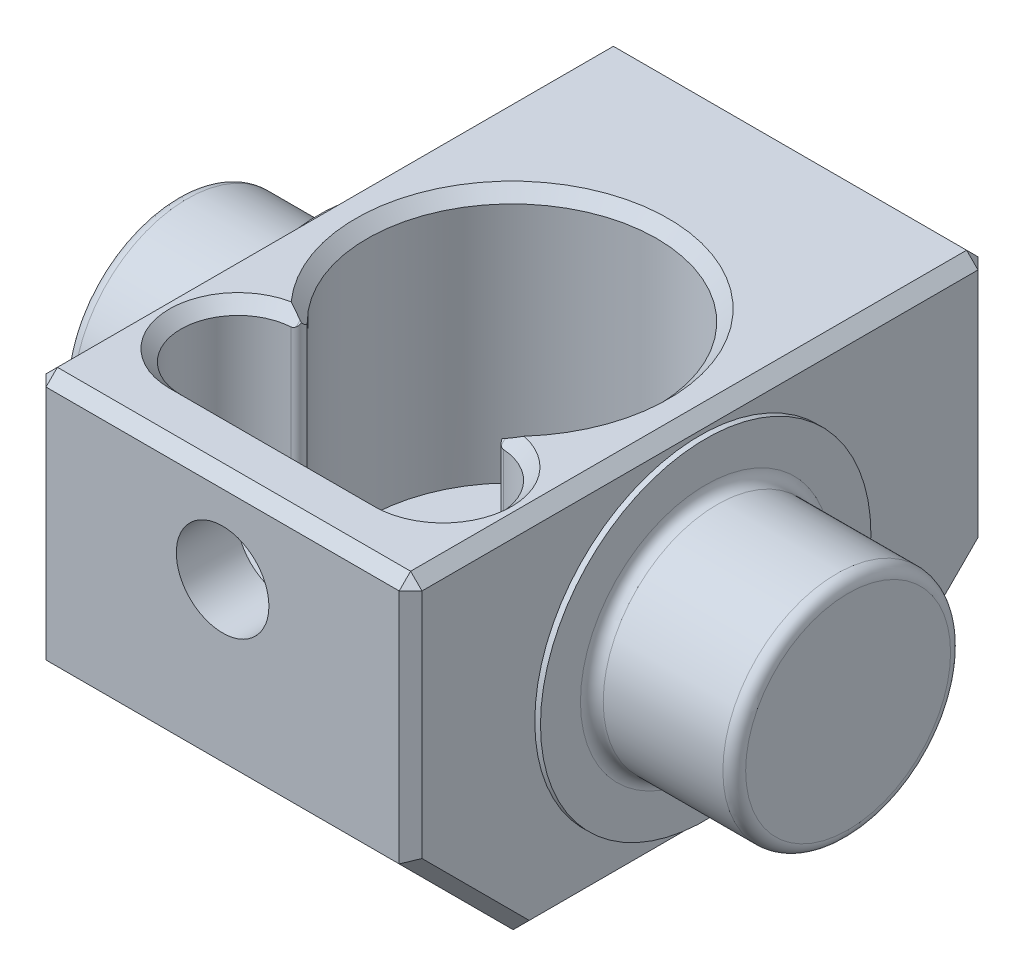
ISO-10303-21;
HEADER;
FILE_DESCRIPTION(('STEP AP214'),'2;1');
FILE_NAME('part.step','',(''),(''),'','','');
FILE_SCHEMA(('AUTOMOTIVE_DESIGN { 1 0 10303 214 1 1 1 1 }'));
ENDSEC;
DATA;
#1=APPLICATION_CONTEXT('core data for automotive mechanical design processes');
#2=APPLICATION_PROTOCOL_DEFINITION('international standard','automotive_design',2000,#1);
#3=PRODUCT_CONTEXT('',#1,'mechanical');
#4=PRODUCT('Part','Part','',(#3));
#5=PRODUCT_RELATED_PRODUCT_CATEGORY('part','',(#4));
#6=PRODUCT_DEFINITION_FORMATION('','',#4);
#7=PRODUCT_DEFINITION_CONTEXT('part definition',#1,'design');
#8=PRODUCT_DEFINITION('design','',#6,#7);
#9=PRODUCT_DEFINITION_SHAPE('','',#8);
#10=(LENGTH_UNIT() NAMED_UNIT(*) SI_UNIT(.MILLI.,.METRE.));
#11=(NAMED_UNIT(*) PLANE_ANGLE_UNIT() SI_UNIT($,.RADIAN.));
#12=(NAMED_UNIT(*) SI_UNIT($,.STERADIAN.) SOLID_ANGLE_UNIT());
#13=UNCERTAINTY_MEASURE_WITH_UNIT(LENGTH_MEASURE(1.E-05),#10,'distance_accuracy_value','');
#14=(GEOMETRIC_REPRESENTATION_CONTEXT(3) GLOBAL_UNCERTAINTY_ASSIGNED_CONTEXT((#13)) GLOBAL_UNIT_ASSIGNED_CONTEXT((#10,
#11,#12)) REPRESENTATION_CONTEXT('',''));
#15=CARTESIAN_POINT('',(0.,0.,0.));
#16=DIRECTION('',(0.,0.,1.));
#17=DIRECTION('',(1.,0.,0.));
#18=AXIS2_PLACEMENT_3D('',#15,#16,#17);
#19=CARTESIAN_POINT('',(-8.25,0.,0.));
#20=DIRECTION('',(1.,0.,0.));
#21=DIRECTION('',(0.,0.,-1.));
#22=AXIS2_PLACEMENT_3D('',#19,#20,#21);
#23=PLANE('',#22);
#24=DIRECTION('',(0.,0.707106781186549,0.707106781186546));
#25=VECTOR('',#24,1.);
#26=CARTESIAN_POINT('',(-8.25,-2.5839466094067,12.3464466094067));
#27=LINE('',#26,#25);
#28=CARTESIAN_POINT('',(-8.25,-7.43749999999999,7.49289321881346));
#29=VERTEX_POINT('',#28);
#30=CARTESIAN_POINT('',(-8.25,-2.73039321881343,12.2));
#31=VERTEX_POINT('',#30);
#32=EDGE_CURVE('E301',#29,#31,#27,.T.);
#33=ORIENTED_EDGE('',*,*,#32,.T.);
#34=DIRECTION('',(0.,1.,0.));
#35=VECTOR('',#34,1.);
#36=CARTESIAN_POINT('',(-8.25,0.,12.2));
#37=LINE('',#36,#35);
#38=CARTESIAN_POINT('',(-8.25,7.4375,12.2));
#39=VERTEX_POINT('',#38);
#40=EDGE_CURVE('E303',#31,#39,#37,.T.);
#41=ORIENTED_EDGE('',*,*,#40,.T.);
#42=DIRECTION('',(0.,0.,-1.));
#43=VECTOR('',#42,1.);
#44=CARTESIAN_POINT('',(-8.25,7.4375,0.));
#45=LINE('',#44,#43);
#46=CARTESIAN_POINT('',(-8.25,7.4375,-12.2));
#47=VERTEX_POINT('',#46);
#48=EDGE_CURVE('E293',#39,#47,#45,.T.);
#49=ORIENTED_EDGE('',*,*,#48,.T.);
#50=DIRECTION('',(0.,-1.,0.));
#51=VECTOR('',#50,1.);
#52=CARTESIAN_POINT('',(-8.25,0.,-12.2));
#53=LINE('',#52,#51);
#54=CARTESIAN_POINT('',(-8.25,-2.73039321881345,-12.2));
#55=VERTEX_POINT('',#54);
#56=EDGE_CURVE('E295',#47,#55,#53,.T.);
#57=ORIENTED_EDGE('',*,*,#56,.T.);
#58=DIRECTION('',(0.,-0.707106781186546,0.707106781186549));
#59=VECTOR('',#58,1.);
#60=CARTESIAN_POINT('',(-8.25,-7.58394660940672,-7.3464466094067));
#61=LINE('',#60,#59);
#62=CARTESIAN_POINT('',(-8.25,-7.43749999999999,-7.49289321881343));
#63=VERTEX_POINT('',#62);
#64=EDGE_CURVE('E297',#55,#63,#61,.T.);
#65=ORIENTED_EDGE('',*,*,#64,.T.);
#66=DIRECTION('',(0.,0.,1.));
#67=VECTOR('',#66,1.);
#68=CARTESIAN_POINT('',(-8.25,-7.43749999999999,0.));
#69=LINE('',#68,#67);
#70=EDGE_CURVE('E299',#63,#29,#69,.T.);
#71=ORIENTED_EDGE('',*,*,#70,.T.);
#72=EDGE_LOOP('',(#33,#41,#49,#57,#65,#71));
#73=FACE_BOUND('',#72,.T.);
#74=CARTESIAN_POINT('',(-8.25,0.,0.));
#75=DIRECTION('',(1.,0.,0.));
#76=DIRECTION('',(0.,0.,-1.));
#77=AXIS2_PLACEMENT_3D('',#74,#75,#76);
#78=CIRCLE('',#77,7.25);
#79=CARTESIAN_POINT('',(-8.25,0.,-7.25));
#80=VERTEX_POINT('',#79);
#81=EDGE_CURVE('E238',#80,#80,#78,.F.);
#82=ORIENTED_EDGE('',*,*,#81,.F.);
#83=EDGE_LOOP('',(#82));
#84=FACE_BOUND('',#83,.T.);
#85=ADVANCED_FACE('F32',(#73,#84),#23,.F.);
#86=CARTESIAN_POINT('',(8.25,0.,0.));
#87=DIRECTION('',(1.,0.,0.));
#88=DIRECTION('',(0.,0.,-1.));
#89=AXIS2_PLACEMENT_3D('',#86,#87,#88);
#90=PLANE('',#89);
#91=DIRECTION('',(0.,-1.,0.));
#92=VECTOR('',#91,1.);
#93=CARTESIAN_POINT('',(8.25,-2.93749999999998,12.2));
#94=LINE('',#93,#92);
#95=CARTESIAN_POINT('',(8.25,7.4375,12.2));
#96=VERTEX_POINT('',#95);
#97=CARTESIAN_POINT('',(8.25,-2.73039321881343,12.2));
#98=VERTEX_POINT('',#97);
#99=EDGE_CURVE('E263',#96,#98,#94,.T.);
#100=ORIENTED_EDGE('',*,*,#99,.T.);
#101=DIRECTION('',(0.,-0.707106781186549,-0.707106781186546));
#102=VECTOR('',#101,1.);
#103=CARTESIAN_POINT('',(8.25,-7.46519660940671,7.46519660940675));
#104=LINE('',#103,#102);
#105=CARTESIAN_POINT('',(8.25,-7.4375,7.49289321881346));
#106=VERTEX_POINT('',#105);
#107=EDGE_CURVE('E265',#98,#106,#104,.T.);
#108=ORIENTED_EDGE('',*,*,#107,.T.);
#109=DIRECTION('',(0.,0.,-1.));
#110=VECTOR('',#109,1.);
#111=CARTESIAN_POINT('',(8.25,-7.4375,-7.69999999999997));
#112=LINE('',#111,#110);
#113=CARTESIAN_POINT('',(8.25,-7.4375,-7.49289321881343));
#114=VERTEX_POINT('',#113);
#115=EDGE_CURVE('E261',#106,#114,#112,.T.);
#116=ORIENTED_EDGE('',*,*,#115,.T.);
#117=DIRECTION('',(0.,0.707106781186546,-0.707106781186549));
#118=VECTOR('',#117,1.);
#119=CARTESIAN_POINT('',(8.25,-7.46519660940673,-7.4651966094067));
#120=LINE('',#119,#118);
#121=CARTESIAN_POINT('',(8.25,-2.73039321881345,-12.2));
#122=VERTEX_POINT('',#121);
#123=EDGE_CURVE('E259',#114,#122,#120,.T.);
#124=ORIENTED_EDGE('',*,*,#123,.T.);
#125=DIRECTION('',(0.,1.,0.));
#126=VECTOR('',#125,1.);
#127=CARTESIAN_POINT('',(8.25,7.9375,-12.2));
#128=LINE('',#127,#126);
#129=CARTESIAN_POINT('',(8.25,7.4375,-12.2));
#130=VERTEX_POINT('',#129);
#131=EDGE_CURVE('E257',#122,#130,#128,.T.);
#132=ORIENTED_EDGE('',*,*,#131,.T.);
#133=DIRECTION('',(0.,0.,1.));
#134=VECTOR('',#133,1.);
#135=CARTESIAN_POINT('',(8.25,7.4375,12.7));
#136=LINE('',#135,#134);
#137=EDGE_CURVE('E255',#130,#96,#136,.T.);
#138=ORIENTED_EDGE('',*,*,#137,.T.);
#139=EDGE_LOOP('',(#100,#108,#116,#124,#132,#138));
#140=FACE_BOUND('',#139,.T.);
#141=CARTESIAN_POINT('',(8.25,0.,0.));
#142=DIRECTION('',(-1.,0.,0.));
#143=DIRECTION('',(0.,0.,1.));
#144=AXIS2_PLACEMENT_3D('',#141,#142,#143);
#145=CIRCLE('',#144,7.25);
#146=CARTESIAN_POINT('',(8.25,0.,7.25));
#147=VERTEX_POINT('',#146);
#148=EDGE_CURVE('E235',#147,#147,#145,.T.);
#149=ORIENTED_EDGE('',*,*,#148,.T.);
#150=EDGE_LOOP('',(#149));
#151=FACE_BOUND('',#150,.T.);
#152=ADVANCED_FACE('F486',(#140,#151),#90,.T.);
#153=CARTESIAN_POINT('',(8.25,7.9375,-12.7));
#154=DIRECTION('',(0.,0.,1.));
#155=DIRECTION('',(0.,-1.,0.));
#156=AXIS2_PLACEMENT_3D('',#153,#154,#155);
#157=PLANE('',#156);
#158=DIRECTION('',(1.,0.,0.));
#159=VECTOR('',#158,1.);
#160=CARTESIAN_POINT('',(8.25,7.4375,-12.7));
#161=LINE('',#160,#159);
#162=CARTESIAN_POINT('',(-7.75,7.4375,-12.7));
#163=VERTEX_POINT('',#162);
#164=CARTESIAN_POINT('',(7.75,7.4375,-12.7));
#165=VERTEX_POINT('',#164);
#166=EDGE_CURVE('E287',#163,#165,#161,.T.);
#167=ORIENTED_EDGE('',*,*,#166,.T.);
#168=DIRECTION('',(0.,-1.,0.));
#169=VECTOR('',#168,1.);
#170=CARTESIAN_POINT('',(7.75,-2.93749999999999,-12.7));
#171=LINE('',#170,#169);
#172=CARTESIAN_POINT('',(7.75,-2.9375,-12.7));
#173=VERTEX_POINT('',#172);
#174=EDGE_CURVE('E291',#165,#173,#171,.T.);
#175=ORIENTED_EDGE('',*,*,#174,.T.);
#176=DIRECTION('',(-1.,0.,0.));
#177=VECTOR('',#176,1.);
#178=CARTESIAN_POINT('',(8.25,-2.9375,-12.7));
#179=LINE('',#178,#177);
#180=CARTESIAN_POINT('',(-7.75,-2.9375,-12.7));
#181=VERTEX_POINT('',#180);
#182=EDGE_CURVE('E243',#173,#181,#179,.T.);
#183=ORIENTED_EDGE('',*,*,#182,.T.);
#184=DIRECTION('',(0.,1.,0.));
#185=VECTOR('',#184,1.);
#186=CARTESIAN_POINT('',(-7.75,7.9375,-12.7));
#187=LINE('',#186,#185);
#188=EDGE_CURVE('E289',#181,#163,#187,.T.);
#189=ORIENTED_EDGE('',*,*,#188,.T.);
#190=EDGE_LOOP('',(#167,#175,#183,#189));
#191=FACE_BOUND('',#190,.T.);
#192=ADVANCED_FACE('F492',(#191),#157,.F.);
#193=CARTESIAN_POINT('',(8.25,7.9375,12.7));
#194=DIRECTION('',(0.,-1.,0.));
#195=DIRECTION('',(0.,0.,-1.));
#196=AXIS2_PLACEMENT_3D('',#193,#194,#195);
#197=PLANE('',#196);
#198=CARTESIAN_POINT('',(4.5,7.9375,7.52729));
#199=DIRECTION('',(0.,-1.,0.));
#200=DIRECTION('',(0.,0.,-1.));
#201=AXIS2_PLACEMENT_3D('',#198,#199,#200);
#202=CIRCLE('',#201,3.00990000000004);
#203=CARTESIAN_POINT('',(5.10977741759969,7.9375,4.57980471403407));
#204=VERTEX_POINT('',#203);
#205=CARTESIAN_POINT('',(4.5,7.9375,10.53719));
#206=VERTEX_POINT('',#205);
#207=EDGE_CURVE('E378',#204,#206,#202,.T.);
#208=ORIENTED_EDGE('',*,*,#207,.T.);
#209=DIRECTION('',(-1.,0.,0.));
#210=VECTOR('',#209,1.);
#211=CARTESIAN_POINT('',(8.25,7.9375,10.53719));
#212=LINE('',#211,#210);
#213=CARTESIAN_POINT('',(-4.5,7.9375,10.53719));
#214=VERTEX_POINT('',#213);
#215=EDGE_CURVE('E380',#206,#214,#212,.T.);
#216=ORIENTED_EDGE('',*,*,#215,.T.);
#217=CARTESIAN_POINT('',(-4.5,7.9375,7.52729));
#218=DIRECTION('',(0.,-1.,0.));
#219=DIRECTION('',(0.,0.,-1.));
#220=AXIS2_PLACEMENT_3D('',#217,#218,#219);
#221=CIRCLE('',#220,3.00990000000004);
#222=CARTESIAN_POINT('',(-5.1097774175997,7.9375,4.57980471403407));
#223=VERTEX_POINT('',#222);
#224=EDGE_CURVE('E374',#214,#223,#221,.T.);
#225=ORIENTED_EDGE('',*,*,#224,.T.);
#226=CARTESIAN_POINT('',(0.,7.9375,0.));
#227=DIRECTION('',(0.,-1.,0.));
#228=DIRECTION('',(0.,0.,-1.));
#229=AXIS2_PLACEMENT_3D('',#226,#227,#228);
#230=CIRCLE('',#229,6.86181000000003);
#231=EDGE_CURVE('E376',#223,#204,#230,.T.);
#232=ORIENTED_EDGE('',*,*,#231,.T.);
#233=EDGE_LOOP('',(#208,#216,#225,#232));
#234=FACE_BOUND('',#233,.T.);
#235=DIRECTION('',(0.,0.,-1.));
#236=VECTOR('',#235,1.);
#237=CARTESIAN_POINT('',(7.75,7.9375,-12.7));
#238=LINE('',#237,#236);
#239=CARTESIAN_POINT('',(7.75,7.9375,12.2));
#240=VERTEX_POINT('',#239);
#241=CARTESIAN_POINT('',(7.75,7.9375,-12.2));
#242=VERTEX_POINT('',#241);
#243=EDGE_CURVE('E310',#240,#242,#238,.T.);
#244=ORIENTED_EDGE('',*,*,#243,.T.);
#245=DIRECTION('',(-1.,0.,0.));
#246=VECTOR('',#245,1.);
#247=CARTESIAN_POINT('',(8.25,7.9375,-12.2));
#248=LINE('',#247,#246);
#249=CARTESIAN_POINT('',(-7.75,7.9375,-12.2));
#250=VERTEX_POINT('',#249);
#251=EDGE_CURVE('E312',#242,#250,#248,.T.);
#252=ORIENTED_EDGE('',*,*,#251,.T.);
#253=DIRECTION('',(0.,0.,1.));
#254=VECTOR('',#253,1.);
#255=CARTESIAN_POINT('',(-7.75,7.9375,12.7));
#256=LINE('',#255,#254);
#257=CARTESIAN_POINT('',(-7.75,7.9375,12.2));
#258=VERTEX_POINT('',#257);
#259=EDGE_CURVE('E306',#250,#258,#256,.T.);
#260=ORIENTED_EDGE('',*,*,#259,.T.);
#261=DIRECTION('',(1.,0.,0.));
#262=VECTOR('',#261,1.);
#263=CARTESIAN_POINT('',(8.25,7.9375,12.2));
#264=LINE('',#263,#262);
#265=EDGE_CURVE('E308',#258,#240,#264,.T.);
#266=ORIENTED_EDGE('',*,*,#265,.T.);
#267=EDGE_LOOP('',(#244,#252,#260,#266));
#268=FACE_BOUND('',#267,.T.);
#269=ADVANCED_FACE('F506',(#234,#268),#197,.F.);
#270=CARTESIAN_POINT('',(8.25,7.9375,12.7));
#271=DIRECTION('',(0.,0.,-1.));
#272=DIRECTION('',(0.,1.,0.));
#273=AXIS2_PLACEMENT_3D('',#270,#271,#272);
#274=PLANE('',#273);
#275=CARTESIAN_POINT('',(0.,3.9975,12.7));
#276=DIRECTION('',(0.,0.,1.));
#277=DIRECTION('',(1.,0.,0.));
#278=AXIS2_PLACEMENT_3D('',#275,#276,#277);
#279=CIRCLE('',#278,2.032);
#280=CARTESIAN_POINT('',(2.032,3.9975,12.7));
#281=VERTEX_POINT('',#280);
#282=EDGE_CURVE('E394',#281,#281,#279,.T.);
#283=ORIENTED_EDGE('',*,*,#282,.F.);
#284=EDGE_LOOP('',(#283));
#285=FACE_BOUND('',#284,.T.);
#286=DIRECTION('',(1.,0.,0.));
#287=VECTOR('',#286,1.);
#288=CARTESIAN_POINT('',(8.25,-2.93749999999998,12.7));
#289=LINE('',#288,#287);
#290=CARTESIAN_POINT('',(-7.75,-2.93749999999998,12.7));
#291=VERTEX_POINT('',#290);
#292=CARTESIAN_POINT('',(7.75,-2.93749999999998,12.7));
#293=VERTEX_POINT('',#292);
#294=EDGE_CURVE('E252',#291,#293,#289,.T.);
#295=ORIENTED_EDGE('',*,*,#294,.T.);
#296=DIRECTION('',(0.,1.,0.));
#297=VECTOR('',#296,1.);
#298=CARTESIAN_POINT('',(7.75,7.9375,12.7));
#299=LINE('',#298,#297);
#300=CARTESIAN_POINT('',(7.75,7.4375,12.7));
#301=VERTEX_POINT('',#300);
#302=EDGE_CURVE('E277',#293,#301,#299,.T.);
#303=ORIENTED_EDGE('',*,*,#302,.T.);
#304=DIRECTION('',(-1.,0.,0.));
#305=VECTOR('',#304,1.);
#306=CARTESIAN_POINT('',(8.25,7.4375,12.7));
#307=LINE('',#306,#305);
#308=CARTESIAN_POINT('',(-7.75,7.4375,12.7));
#309=VERTEX_POINT('',#308);
#310=EDGE_CURVE('E273',#301,#309,#307,.T.);
#311=ORIENTED_EDGE('',*,*,#310,.T.);
#312=DIRECTION('',(0.,-1.,0.));
#313=VECTOR('',#312,1.);
#314=CARTESIAN_POINT('',(-7.75,7.9375,12.7));
#315=LINE('',#314,#313);
#316=EDGE_CURVE('E275',#309,#291,#315,.T.);
#317=ORIENTED_EDGE('',*,*,#316,.T.);
#318=EDGE_LOOP('',(#295,#303,#311,#317));
#319=FACE_BOUND('',#318,.T.);
#320=ADVANCED_FACE('F502',(#285,#319),#274,.F.);
#321=CARTESIAN_POINT('',(8.25,-7.9375,12.7));
#322=DIRECTION('',(0.,1.,0.));
#323=DIRECTION('',(0.,0.,1.));
#324=AXIS2_PLACEMENT_3D('',#321,#322,#323);
#325=PLANE('',#324);
#326=CARTESIAN_POINT('',(0.,-7.9375,0.));
#327=DIRECTION('',(0.,1.,0.));
#328=DIRECTION('',(0.,0.,1.));
#329=AXIS2_PLACEMENT_3D('',#326,#327,#328);
#330=CIRCLE('',#329,4.071875);
#331=CARTESIAN_POINT('',(0.,-7.9375,4.071875));
#332=VERTEX_POINT('',#331);
#333=EDGE_CURVE('E627',#332,#332,#330,.T.);
#334=ORIENTED_EDGE('',*,*,#333,.T.);
#335=EDGE_LOOP('',(#334));
#336=FACE_BOUND('',#335,.T.);
#337=DIRECTION('',(1.,0.,0.));
#338=VECTOR('',#337,1.);
#339=CARTESIAN_POINT('',(8.25,-7.9375,-7.69999999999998));
#340=LINE('',#339,#338);
#341=CARTESIAN_POINT('',(-7.75,-7.9375,-7.69999999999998));
#342=VERTEX_POINT('',#341);
#343=CARTESIAN_POINT('',(7.75,-7.9375,-7.69999999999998));
#344=VERTEX_POINT('',#343);
#345=EDGE_CURVE('E249',#342,#344,#340,.T.);
#346=ORIENTED_EDGE('',*,*,#345,.T.);
#347=DIRECTION('',(0.,0.,1.));
#348=VECTOR('',#347,1.);
#349=CARTESIAN_POINT('',(7.75,-7.9375,7.70000000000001));
#350=LINE('',#349,#348);
#351=CARTESIAN_POINT('',(7.75,-7.9375,7.70000000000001));
#352=VERTEX_POINT('',#351);
#353=EDGE_CURVE('E281',#344,#352,#350,.T.);
#354=ORIENTED_EDGE('',*,*,#353,.T.);
#355=DIRECTION('',(-1.,0.,0.));
#356=VECTOR('',#355,1.);
#357=CARTESIAN_POINT('',(8.25,-7.9375,7.70000000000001));
#358=LINE('',#357,#356);
#359=CARTESIAN_POINT('',(-7.75,-7.9375,7.70000000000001));
#360=VERTEX_POINT('',#359);
#361=EDGE_CURVE('E246',#352,#360,#358,.T.);
#362=ORIENTED_EDGE('',*,*,#361,.T.);
#363=DIRECTION('',(0.,0.,-1.));
#364=VECTOR('',#363,1.);
#365=CARTESIAN_POINT('',(-7.75,-7.9375,12.7));
#366=LINE('',#365,#364);
#367=EDGE_CURVE('E279',#360,#342,#366,.T.);
#368=ORIENTED_EDGE('',*,*,#367,.T.);
#369=EDGE_LOOP('',(#346,#354,#362,#368));
#370=FACE_BOUND('',#369,.T.);
#371=ADVANCED_FACE('F498',(#336,#370),#325,.F.);
#372=CARTESIAN_POINT('',(0.,0.,0.));
#373=DIRECTION('',(-1.,0.,0.));
#374=DIRECTION('',(0.,0.,1.));
#375=AXIS2_PLACEMENT_3D('',#372,#373,#374);
#376=CYLINDRICAL_SURFACE('',#375,7.25);
#377=ORIENTED_EDGE('',*,*,#148,.F.);
#378=EDGE_LOOP('',(#377));
#379=FACE_BOUND('',#378,.T.);
#380=CARTESIAN_POINT('',(8.5,0.,0.));
#381=DIRECTION('',(-1.,0.,0.));
#382=DIRECTION('',(0.,0.,1.));
#383=AXIS2_PLACEMENT_3D('',#380,#381,#382);
#384=CIRCLE('',#383,7.25);
#385=CARTESIAN_POINT('',(8.5,0.,7.25));
#386=VERTEX_POINT('',#385);
#387=EDGE_CURVE('E232',#386,#386,#384,.T.);
#388=ORIENTED_EDGE('',*,*,#387,.T.);
#389=EDGE_LOOP('',(#388));
#390=FACE_BOUND('',#389,.T.);
#391=ADVANCED_FACE('F501',(#379,#390),#376,.T.);
#392=CARTESIAN_POINT('',(8.5,7.25,0.));
#393=DIRECTION('',(-1.,0.,0.));
#394=DIRECTION('',(0.,0.,1.));
#395=AXIS2_PLACEMENT_3D('',#392,#393,#394);
#396=PLANE('',#395);
#397=CARTESIAN_POINT('',(8.5,0.,0.));
#398=DIRECTION('',(-1.,0.,0.));
#399=DIRECTION('',(0.,0.,1.));
#400=AXIS2_PLACEMENT_3D('',#397,#398,#399);
#401=CIRCLE('',#400,5.496190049);
#402=CARTESIAN_POINT('',(8.5,0.,5.496190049));
#403=VERTEX_POINT('',#402);
#404=EDGE_CURVE('E642',#403,#403,#401,.T.);
#405=ORIENTED_EDGE('',*,*,#404,.T.);
#406=EDGE_LOOP('',(#405));
#407=FACE_BOUND('',#406,.T.);
#408=ORIENTED_EDGE('',*,*,#387,.F.);
#409=EDGE_LOOP('',(#408));
#410=FACE_BOUND('',#409,.T.);
#411=ADVANCED_FACE('F688',(#407,#410),#396,.F.);
#412=CARTESIAN_POINT('',(0.,0.,0.));
#413=DIRECTION('',(-1.,0.,0.));
#414=DIRECTION('',(0.,0.,1.));
#415=AXIS2_PLACEMENT_3D('',#412,#413,#414);
#416=CYLINDRICAL_SURFACE('',#415,4.996190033);
#417=CARTESIAN_POINT('',(9.000000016,0.,0.));
#418=DIRECTION('',(-1.,0.,0.));
#419=DIRECTION('',(0.,0.,1.));
#420=AXIS2_PLACEMENT_3D('',#417,#418,#419);
#421=CIRCLE('',#420,4.996190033);
#422=CARTESIAN_POINT('',(9.000000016,0.,4.996190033));
#423=VERTEX_POINT('',#422);
#424=EDGE_CURVE('E645',#423,#423,#421,.F.);
#425=ORIENTED_EDGE('',*,*,#424,.T.);
#426=EDGE_LOOP('',(#425));
#427=FACE_BOUND('',#426,.T.);
#428=CARTESIAN_POINT('',(14.249999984,0.,0.));
#429=DIRECTION('',(-1.,0.,0.));
#430=DIRECTION('',(0.,0.,1.));
#431=AXIS2_PLACEMENT_3D('',#428,#429,#430);
#432=CIRCLE('',#431,4.996190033);
#433=CARTESIAN_POINT('',(14.249999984,0.,4.996190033));
#434=VERTEX_POINT('',#433);
#435=EDGE_CURVE('E636',#434,#434,#432,.T.);
#436=ORIENTED_EDGE('',*,*,#435,.T.);
#437=EDGE_LOOP('',(#436));
#438=FACE_BOUND('',#437,.T.);
#439=ADVANCED_FACE('F681',(#427,#438),#416,.T.);
#440=CARTESIAN_POINT('',(14.75,4.996190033,0.));
#441=DIRECTION('',(-1.,0.,0.));
#442=DIRECTION('',(0.,0.,1.));
#443=AXIS2_PLACEMENT_3D('',#440,#441,#442);
#444=PLANE('',#443);
#445=CARTESIAN_POINT('',(14.75,0.,0.));
#446=DIRECTION('',(-1.,0.,0.));
#447=DIRECTION('',(0.,0.,1.));
#448=AXIS2_PLACEMENT_3D('',#445,#446,#447);
#449=CIRCLE('',#448,4.496190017);
#450=CARTESIAN_POINT('',(14.75,0.,4.496190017));
#451=VERTEX_POINT('',#450);
#452=EDGE_CURVE('E639',#451,#451,#449,.F.);
#453=ORIENTED_EDGE('',*,*,#452,.T.);
#454=EDGE_LOOP('',(#453));
#455=FACE_BOUND('',#454,.T.);
#456=ADVANCED_FACE('F675',(#455),#444,.F.);
#457=CARTESIAN_POINT('',(0.,0.,0.));
#458=DIRECTION('',(1.,0.,0.));
#459=DIRECTION('',(0.,0.,1.));
#460=AXIS2_PLACEMENT_3D('',#457,#458,#459);
#461=CYLINDRICAL_SURFACE('',#460,7.25);
#462=ORIENTED_EDGE('',*,*,#81,.T.);
#463=EDGE_LOOP('',(#462));
#464=FACE_BOUND('',#463,.T.);
#465=CARTESIAN_POINT('',(-8.5,0.,0.));
#466=DIRECTION('',(-1.,0.,0.));
#467=DIRECTION('',(0.,0.,1.));
#468=AXIS2_PLACEMENT_3D('',#465,#466,#467);
#469=CIRCLE('',#468,7.25);
#470=CARTESIAN_POINT('',(-8.5,0.,7.25));
#471=VERTEX_POINT('',#470);
#472=EDGE_CURVE('E229',#471,#471,#469,.T.);
#473=ORIENTED_EDGE('',*,*,#472,.F.);
#474=EDGE_LOOP('',(#473));
#475=FACE_BOUND('',#474,.T.);
#476=ADVANCED_FACE('F670',(#464,#475),#461,.T.);
#477=CARTESIAN_POINT('',(-8.5,7.25,0.));
#478=DIRECTION('',(1.,0.,0.));
#479=DIRECTION('',(0.,0.,1.));
#480=AXIS2_PLACEMENT_3D('',#477,#478,#479);
#481=PLANE('',#480);
#482=CARTESIAN_POINT('',(-8.5,0.,0.));
#483=DIRECTION('',(1.,0.,0.));
#484=DIRECTION('',(0.,0.,-1.));
#485=AXIS2_PLACEMENT_3D('',#482,#483,#484);
#486=CIRCLE('',#485,5.496190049);
#487=CARTESIAN_POINT('',(-8.5,0.,-5.496190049));
#488=VERTEX_POINT('',#487);
#489=EDGE_CURVE('E11',#488,#488,#486,.T.);
#490=ORIENTED_EDGE('',*,*,#489,.T.);
#491=EDGE_LOOP('',(#490));
#492=FACE_BOUND('',#491,.T.);
#493=ORIENTED_EDGE('',*,*,#472,.T.);
#494=EDGE_LOOP('',(#493));
#495=FACE_BOUND('',#494,.T.);
#496=ADVANCED_FACE('F667',(#492,#495),#481,.F.);
#497=CARTESIAN_POINT('',(0.,0.,0.));
#498=DIRECTION('',(1.,0.,0.));
#499=DIRECTION('',(0.,0.,1.));
#500=AXIS2_PLACEMENT_3D('',#497,#498,#499);
#501=CYLINDRICAL_SURFACE('',#500,4.996190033);
#502=CARTESIAN_POINT('',(-9.000000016,0.,0.));
#503=DIRECTION('',(1.,0.,0.));
#504=DIRECTION('',(0.,0.,-1.));
#505=AXIS2_PLACEMENT_3D('',#502,#503,#504);
#506=CIRCLE('',#505,4.996190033);
#507=CARTESIAN_POINT('',(-9.000000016,0.,-4.996190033));
#508=VERTEX_POINT('',#507);
#509=EDGE_CURVE('E40',#508,#508,#506,.F.);
#510=ORIENTED_EDGE('',*,*,#509,.T.);
#511=EDGE_LOOP('',(#510));
#512=FACE_BOUND('',#511,.T.);
#513=CARTESIAN_POINT('',(-14.249999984,0.,0.));
#514=DIRECTION('',(1.,0.,0.));
#515=DIRECTION('',(0.,0.,-1.));
#516=AXIS2_PLACEMENT_3D('',#513,#514,#515);
#517=CIRCLE('',#516,4.996190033);
#518=CARTESIAN_POINT('',(-14.249999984,0.,-4.996190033));
#519=VERTEX_POINT('',#518);
#520=EDGE_CURVE('E633',#519,#519,#517,.T.);
#521=ORIENTED_EDGE('',*,*,#520,.T.);
#522=EDGE_LOOP('',(#521));
#523=FACE_BOUND('',#522,.T.);
#524=ADVANCED_FACE('F650',(#512,#523),#501,.T.);
#525=CARTESIAN_POINT('',(-14.75,4.996190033,0.));
#526=DIRECTION('',(1.,0.,0.));
#527=DIRECTION('',(0.,0.,1.));
#528=AXIS2_PLACEMENT_3D('',#525,#526,#527);
#529=PLANE('',#528);
#530=CARTESIAN_POINT('',(-14.75,0.,0.));
#531=DIRECTION('',(1.,0.,0.));
#532=DIRECTION('',(0.,0.,-1.));
#533=AXIS2_PLACEMENT_3D('',#530,#531,#532);
#534=CIRCLE('',#533,4.496190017);
#535=CARTESIAN_POINT('',(-14.75,0.,-4.496190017));
#536=VERTEX_POINT('',#535);
#537=EDGE_CURVE('E630',#536,#536,#534,.F.);
#538=ORIENTED_EDGE('',*,*,#537,.T.);
#539=EDGE_LOOP('',(#538));
#540=FACE_BOUND('',#539,.T.);
#541=ADVANCED_FACE('F729',(#540),#529,.F.);
#542=CARTESIAN_POINT('',(0.,-3.175,0.));
#543=DIRECTION('',(0.,-1.,0.));
#544=DIRECTION('',(0.,0.,-1.));
#545=AXIS2_PLACEMENT_3D('',#542,#543,#544);
#546=PLANE('',#545);
#547=CARTESIAN_POINT('',(0.,-3.175,0.));
#548=DIRECTION('',(0.,-1.,0.));
#549=DIRECTION('',(0.,0.,-1.));
#550=AXIS2_PLACEMENT_3D('',#547,#548,#549);
#551=CIRCLE('',#550,4.07187500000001);
#552=CARTESIAN_POINT('',(0.,-3.175,-4.07187500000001));
#553=VERTEX_POINT('',#552);
#554=EDGE_CURVE('E624',#553,#553,#551,.T.);
#555=ORIENTED_EDGE('',*,*,#554,.T.);
#556=EDGE_LOOP('',(#555));
#557=FACE_BOUND('',#556,.T.);
#558=CARTESIAN_POINT('',(0.,-3.175,0.));
#559=DIRECTION('',(0.,1.,0.));
#560=DIRECTION('',(0.,0.,1.));
#561=AXIS2_PLACEMENT_3D('',#558,#559,#560);
#562=CIRCLE('',#561,6.35381);
#563=CARTESIAN_POINT('',(0.,-3.175,6.35381));
#564=VERTEX_POINT('',#563);
#565=EDGE_CURVE('E225',#564,#564,#562,.T.);
#566=ORIENTED_EDGE('',*,*,#565,.T.);
#567=EDGE_LOOP('',(#566));
#568=FACE_BOUND('',#567,.T.);
#569=ADVANCED_FACE('F734',(#557,#568),#546,.F.);
#570=CARTESIAN_POINT('',(0.,10.1246822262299,0.));
#571=DIRECTION('',(0.,1.,0.));
#572=DIRECTION('',(0.,0.,1.));
#573=AXIS2_PLACEMENT_3D('',#570,#571,#572);
#574=CYLINDRICAL_SURFACE('',#573,6.35381);
#575=CARTESIAN_POINT('',(0.,1.4375,0.));
#576=DIRECTION('',(0.,1.,0.));
#577=DIRECTION('',(0.,0.,1.));
#578=AXIS2_PLACEMENT_3D('',#575,#576,#577);
#579=CIRCLE('',#578,6.35381);
#580=CARTESIAN_POINT('',(4.46772290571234,1.4375,4.5177819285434));
#581=VERTEX_POINT('',#580);
#582=CARTESIAN_POINT('',(-4.46772290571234,1.4375,4.5177819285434));
#583=VERTEX_POINT('',#582);
#584=EDGE_CURVE('E241',#581,#583,#579,.F.);
#585=ORIENTED_EDGE('',*,*,#584,.F.);
#586=DIRECTION('',(0.,1.,0.));
#587=VECTOR('',#586,1.);
#588=CARTESIAN_POINT('',(4.46772290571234,10.1246822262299,4.5177819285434));
#589=LINE('',#588,#587);
#590=CARTESIAN_POINT('',(4.46772290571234,7.42949999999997,4.5177819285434));
#591=VERTEX_POINT('',#590);
#592=EDGE_CURVE('E453',#581,#591,#589,.T.);
#593=ORIENTED_EDGE('',*,*,#592,.T.);
#594=CARTESIAN_POINT('',(0.,7.42949999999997,0.));
#595=DIRECTION('',(0.,-1.,0.));
#596=DIRECTION('',(0.,0.,-1.));
#597=AXIS2_PLACEMENT_3D('',#594,#595,#596);
#598=CIRCLE('',#597,6.35381);
#599=CARTESIAN_POINT('',(-4.46772290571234,7.42949999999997,4.5177819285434));
#600=VERTEX_POINT('',#599);
#601=EDGE_CURVE('E386',#591,#600,#598,.F.);
#602=ORIENTED_EDGE('',*,*,#601,.T.);
#603=DIRECTION('',(0.,1.,0.));
#604=VECTOR('',#603,1.);
#605=CARTESIAN_POINT('',(-4.46772290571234,10.1246822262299,4.5177819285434));
#606=LINE('',#605,#604);
#607=EDGE_CURVE('E390',#600,#583,#606,.F.);
#608=ORIENTED_EDGE('',*,*,#607,.T.);
#609=EDGE_LOOP('',(#585,#593,#602,#608));
#610=FACE_BOUND('',#609,.T.);
#611=ORIENTED_EDGE('',*,*,#565,.F.);
#612=EDGE_LOOP('',(#611));
#613=FACE_BOUND('',#612,.T.);
#614=ADVANCED_FACE('F898',(#610,#613),#574,.F.);
#615=CARTESIAN_POINT('',(0.,-1.92521317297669,0.));
#616=DIRECTION('',(0.,1.,0.));
#617=DIRECTION('',(0.,0.,1.));
#618=AXIS2_PLACEMENT_3D('',#615,#616,#617);
#619=CYLINDRICAL_SURFACE('',#618,3.571875);
#620=CARTESIAN_POINT('',(0.,-3.67500000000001,0.));
#621=DIRECTION('',(0.,-1.,0.));
#622=DIRECTION('',(0.,0.,-1.));
#623=AXIS2_PLACEMENT_3D('',#620,#621,#622);
#624=CIRCLE('',#623,3.571875);
#625=CARTESIAN_POINT('',(0.,-3.67500000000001,-3.571875));
#626=VERTEX_POINT('',#625);
#627=EDGE_CURVE('E621',#626,#626,#624,.F.);
#628=ORIENTED_EDGE('',*,*,#627,.T.);
#629=EDGE_LOOP('',(#628));
#630=FACE_BOUND('',#629,.T.);
#631=CARTESIAN_POINT('',(0.,-7.4375,0.));
#632=DIRECTION('',(0.,1.,0.));
#633=DIRECTION('',(0.,0.,1.));
#634=AXIS2_PLACEMENT_3D('',#631,#632,#633);
#635=CIRCLE('',#634,3.571875);
#636=CARTESIAN_POINT('',(0.,-7.4375,3.571875));
#637=VERTEX_POINT('',#636);
#638=EDGE_CURVE('E614',#637,#637,#635,.F.);
#639=ORIENTED_EDGE('',*,*,#638,.T.);
#640=EDGE_LOOP('',(#639));
#641=FACE_BOUND('',#640,.T.);
#642=ADVANCED_FACE('F903',(#630,#641),#619,.F.);
#643=CARTESIAN_POINT('',(-4.5,1.4375,7.52729));
#644=DIRECTION('',(0.,1.,0.));
#645=DIRECTION('',(0.,0.,1.));
#646=AXIS2_PLACEMENT_3D('',#643,#644,#645);
#647=PLANE('',#646);
#648=ORIENTED_EDGE('',*,*,#584,.T.);
#649=CARTESIAN_POINT('',(-4.6786698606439,1.4375,4.73109245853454));
#650=DIRECTION('',(0.,1.,0.));
#651=DIRECTION('',(0.,0.,1.));
#652=AXIS2_PLACEMENT_3D('',#649,#650,#651);
#653=CIRCLE('',#652,0.3);
#654=CARTESIAN_POINT('',(-4.65953964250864,1.4375,5.03048189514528));
#655=VERTEX_POINT('',#654);
#656=EDGE_CURVE('E55',#583,#655,#653,.F.);
#657=ORIENTED_EDGE('',*,*,#656,.T.);
#658=CARTESIAN_POINT('',(-4.5,1.4375,7.52729));
#659=DIRECTION('',(0.,1.,0.));
#660=DIRECTION('',(0.,0.,1.));
#661=AXIS2_PLACEMENT_3D('',#658,#659,#660);
#662=CIRCLE('',#661,2.5019);
#663=CARTESIAN_POINT('',(-4.5,1.4375,10.02919));
#664=VERTEX_POINT('',#663);
#665=EDGE_CURVE('E198',#655,#664,#662,.T.);
#666=ORIENTED_EDGE('',*,*,#665,.T.);
#667=DIRECTION('',(1.,0.,0.));
#668=VECTOR('',#667,1.);
#669=CARTESIAN_POINT('',(-4.5,1.4375,10.02919));
#670=LINE('',#669,#668);
#671=CARTESIAN_POINT('',(4.5,1.4375,10.02919));
#672=VERTEX_POINT('',#671);
#673=EDGE_CURVE('E203',#664,#672,#670,.T.);
#674=ORIENTED_EDGE('',*,*,#673,.T.);
#675=CARTESIAN_POINT('',(4.5,1.4375,7.52729));
#676=DIRECTION('',(0.,1.,0.));
#677=DIRECTION('',(0.,0.,1.));
#678=AXIS2_PLACEMENT_3D('',#675,#676,#677);
#679=CIRCLE('',#678,2.5019);
#680=CARTESIAN_POINT('',(4.65953964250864,1.4375,5.03048189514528));
#681=VERTEX_POINT('',#680);
#682=EDGE_CURVE('E216',#672,#681,#679,.T.);
#683=ORIENTED_EDGE('',*,*,#682,.T.);
#684=CARTESIAN_POINT('',(4.6786698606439,1.4375,4.73109245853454));
#685=DIRECTION('',(0.,1.,0.));
#686=DIRECTION('',(0.,0.,1.));
#687=AXIS2_PLACEMENT_3D('',#684,#685,#686);
#688=CIRCLE('',#687,0.3);
#689=EDGE_CURVE('E610',#681,#581,#688,.F.);
#690=ORIENTED_EDGE('',*,*,#689,.T.);
#691=EDGE_LOOP('',(#648,#657,#666,#674,#683,#690));
#692=FACE_BOUND('',#691,.T.);
#693=ADVANCED_FACE('F200',(#692),#647,.T.);
#694=CARTESIAN_POINT('',(-4.5,1.4375,7.52729));
#695=DIRECTION('',(0.,1.,0.));
#696=DIRECTION('',(0.,0.,1.));
#697=AXIS2_PLACEMENT_3D('',#694,#695,#696);
#698=CYLINDRICAL_SURFACE('',#697,2.5019);
#699=ORIENTED_EDGE('',*,*,#665,.F.);
#700=DIRECTION('',(0.,1.,0.));
#701=VECTOR('',#700,1.);
#702=CARTESIAN_POINT('',(-4.65953964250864,1.4375,5.03048189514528));
#703=LINE('',#702,#701);
#704=CARTESIAN_POINT('',(-4.65953964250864,7.42949999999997,5.03048189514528));
#705=VERTEX_POINT('',#704);
#706=EDGE_CURVE('E1096',#655,#705,#703,.T.);
#707=ORIENTED_EDGE('',*,*,#706,.T.);
#708=CARTESIAN_POINT('',(-4.5,7.42949999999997,7.52729));
#709=DIRECTION('',(0.,-1.,0.));
#710=DIRECTION('',(0.,0.,-1.));
#711=AXIS2_PLACEMENT_3D('',#708,#709,#710);
#712=CIRCLE('',#711,2.5019);
#713=CARTESIAN_POINT('',(-4.5,7.42949999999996,10.02919));
#714=VERTEX_POINT('',#713);
#715=EDGE_CURVE('E211',#705,#714,#712,.F.);
#716=ORIENTED_EDGE('',*,*,#715,.T.);
#717=DIRECTION('',(0.,1.,0.));
#718=VECTOR('',#717,1.);
#719=CARTESIAN_POINT('',(-4.5,1.4375,10.02919));
#720=LINE('',#719,#718);
#721=EDGE_CURVE('E209',#664,#714,#720,.T.);
#722=ORIENTED_EDGE('',*,*,#721,.F.);
#723=EDGE_LOOP('',(#699,#707,#716,#722));
#724=FACE_BOUND('',#723,.T.);
#725=ADVANCED_FACE('F210',(#724),#698,.F.);
#726=CARTESIAN_POINT('',(4.5,1.4375,7.52729));
#727=DIRECTION('',(0.,1.,0.));
#728=DIRECTION('',(0.,0.,1.));
#729=AXIS2_PLACEMENT_3D('',#726,#727,#728);
#730=CYLINDRICAL_SURFACE('',#729,2.5019);
#731=CARTESIAN_POINT('',(4.5,7.42949999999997,7.52729));
#732=DIRECTION('',(0.,-1.,0.));
#733=DIRECTION('',(0.,0.,-1.));
#734=AXIS2_PLACEMENT_3D('',#731,#732,#733);
#735=CIRCLE('',#734,2.5019);
#736=CARTESIAN_POINT('',(4.5,7.42949999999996,10.02919));
#737=VERTEX_POINT('',#736);
#738=CARTESIAN_POINT('',(4.65953964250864,7.42949999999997,5.03048189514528));
#739=VERTEX_POINT('',#738);
#740=EDGE_CURVE('E383',#737,#739,#735,.F.);
#741=ORIENTED_EDGE('',*,*,#740,.T.);
#742=DIRECTION('',(0.,1.,0.));
#743=VECTOR('',#742,1.);
#744=CARTESIAN_POINT('',(4.65953964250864,1.4375,5.03048189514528));
#745=LINE('',#744,#743);
#746=EDGE_CURVE('E427',#739,#681,#745,.F.);
#747=ORIENTED_EDGE('',*,*,#746,.T.);
#748=ORIENTED_EDGE('',*,*,#682,.F.);
#749=DIRECTION('',(0.,1.,0.));
#750=VECTOR('',#749,1.);
#751=CARTESIAN_POINT('',(4.5,1.4375,10.02919));
#752=LINE('',#751,#750);
#753=EDGE_CURVE('E215',#672,#737,#752,.T.);
#754=ORIENTED_EDGE('',*,*,#753,.T.);
#755=EDGE_LOOP('',(#741,#747,#748,#754));
#756=FACE_BOUND('',#755,.T.);
#757=ADVANCED_FACE('F607',(#756),#730,.F.);
#758=CARTESIAN_POINT('',(-4.5,1.4375,10.02919));
#759=DIRECTION('',(0.,0.,1.));
#760=DIRECTION('',(1.,0.,0.));
#761=AXIS2_PLACEMENT_3D('',#758,#759,#760);
#762=PLANE('',#761);
#763=CARTESIAN_POINT('',(0.,3.9975,10.02919));
#764=DIRECTION('',(0.,0.,1.));
#765=DIRECTION('',(1.,0.,0.));
#766=AXIS2_PLACEMENT_3D('',#763,#764,#765);
#767=CIRCLE('',#766,2.032);
#768=CARTESIAN_POINT('',(2.032,3.9975,10.02919));
#769=VERTEX_POINT('',#768);
#770=EDGE_CURVE('E1148',#769,#769,#767,.F.);
#771=ORIENTED_EDGE('',*,*,#770,.F.);
#772=EDGE_LOOP('',(#771));
#773=FACE_BOUND('',#772,.T.);
#774=ORIENTED_EDGE('',*,*,#721,.T.);
#775=DIRECTION('',(1.,0.,0.));
#776=VECTOR('',#775,1.);
#777=CARTESIAN_POINT('',(-4.5,7.42949999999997,10.02919));
#778=LINE('',#777,#776);
#779=EDGE_CURVE('E315',#714,#737,#778,.T.);
#780=ORIENTED_EDGE('',*,*,#779,.T.);
#781=ORIENTED_EDGE('',*,*,#753,.F.);
#782=ORIENTED_EDGE('',*,*,#673,.F.);
#783=EDGE_LOOP('',(#774,#780,#781,#782));
#784=FACE_BOUND('',#783,.T.);
#785=ADVANCED_FACE('F218',(#773,#784),#762,.F.);
#786=CARTESIAN_POINT('',(8.25,-2.9375,-12.7));
#787=DIRECTION('',(0.,0.707106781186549,0.707106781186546));
#788=DIRECTION('',(-1.,0.,0.));
#789=AXIS2_PLACEMENT_3D('',#786,#787,#788);
#790=PLANE('',#789);
#791=ORIENTED_EDGE('',*,*,#182,.F.);
#792=DIRECTION('',(0.,0.707106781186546,-0.707106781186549));
#793=VECTOR('',#792,1.);
#794=CARTESIAN_POINT('',(7.75,-2.9375,-12.7));
#795=LINE('',#794,#793);
#796=EDGE_CURVE('E285',#173,#344,#795,.F.);
#797=ORIENTED_EDGE('',*,*,#796,.T.);
#798=ORIENTED_EDGE('',*,*,#345,.F.);
#799=DIRECTION('',(0.,-0.707106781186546,0.707106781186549));
#800=VECTOR('',#799,1.);
#801=CARTESIAN_POINT('',(-7.75,-2.9375,-12.7));
#802=LINE('',#801,#800);
#803=EDGE_CURVE('E283',#342,#181,#802,.F.);
#804=ORIENTED_EDGE('',*,*,#803,.T.);
#805=EDGE_LOOP('',(#791,#797,#798,#804));
#806=FACE_BOUND('',#805,.T.);
#807=ADVANCED_FACE('F514',(#806),#790,.F.);
#808=CARTESIAN_POINT('',(8.25,-7.9375,7.70000000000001));
#809=DIRECTION('',(0.,0.707106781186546,-0.707106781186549));
#810=DIRECTION('',(-1.,0.,0.));
#811=AXIS2_PLACEMENT_3D('',#808,#809,#810);
#812=PLANE('',#811);
#813=ORIENTED_EDGE('',*,*,#361,.F.);
#814=DIRECTION('',(0.,-0.707106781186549,-0.707106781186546));
#815=VECTOR('',#814,1.);
#816=CARTESIAN_POINT('',(7.75,-7.9375,7.70000000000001));
#817=LINE('',#816,#815);
#818=EDGE_CURVE('E270',#352,#293,#817,.F.);
#819=ORIENTED_EDGE('',*,*,#818,.T.);
#820=ORIENTED_EDGE('',*,*,#294,.F.);
#821=DIRECTION('',(0.,0.707106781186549,0.707106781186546));
#822=VECTOR('',#821,1.);
#823=CARTESIAN_POINT('',(-7.75,-7.9375,7.70000000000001));
#824=LINE('',#823,#822);
#825=EDGE_CURVE('E268',#291,#360,#824,.F.);
#826=ORIENTED_EDGE('',*,*,#825,.T.);
#827=EDGE_LOOP('',(#813,#819,#820,#826));
#828=FACE_BOUND('',#827,.T.);
#829=ADVANCED_FACE('F517',(#828),#812,.F.);
#830=CARTESIAN_POINT('',(-8.25,-7.46519660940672,-7.4651966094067));
#831=DIRECTION('',(0.70710678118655,0.499999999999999,0.499999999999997));
#832=DIRECTION('',(0.,-0.707106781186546,0.707106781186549));
#833=AXIS2_PLACEMENT_3D('',#830,#831,#832);
#834=PLANE('',#833);
#835=DIRECTION('',(-0.678598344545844,0.281084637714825,0.678598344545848));
#836=VECTOR('',#835,1.);
#837=CARTESIAN_POINT('',(-9.82433632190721,-2.07828176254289,-10.6256636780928));
#838=LINE('',#837,#836);
#839=EDGE_CURVE('E368',#181,#55,#838,.T.);
#840=ORIENTED_EDGE('',*,*,#839,.F.);
#841=ORIENTED_EDGE('',*,*,#803,.F.);
#842=DIRECTION('',(-0.678598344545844,0.678598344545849,0.281084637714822));
#843=VECTOR('',#842,1.);
#844=CARTESIAN_POINT('',(-8.24252878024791,-7.44497121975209,-7.49598789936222));
#845=LINE('',#844,#843);
#846=EDGE_CURVE('E206',#63,#342,#845,.F.);
#847=ORIENTED_EDGE('',*,*,#846,.F.);
#848=ORIENTED_EDGE('',*,*,#64,.F.);
#849=EDGE_LOOP('',(#840,#841,#847,#848));
#850=FACE_BOUND('',#849,.T.);
#851=ADVANCED_FACE('F520',(#850),#834,.F.);
#852=CARTESIAN_POINT('',(-7.75,-7.9375,12.7));
#853=DIRECTION('',(0.70710678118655,0.707106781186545,0.));
#854=DIRECTION('',(0.,0.,-1.));
#855=AXIS2_PLACEMENT_3D('',#852,#853,#854);
#856=PLANE('',#855);
#857=ORIENTED_EDGE('',*,*,#846,.T.);
#858=ORIENTED_EDGE('',*,*,#367,.F.);
#859=DIRECTION('',(-0.678598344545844,0.678598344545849,-0.281084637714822));
#860=VECTOR('',#859,1.);
#861=CARTESIAN_POINT('',(-6.79628215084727,-8.89121784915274,8.09504286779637));
#862=LINE('',#861,#860);
#863=EDGE_CURVE('E365',#29,#360,#862,.F.);
#864=ORIENTED_EDGE('',*,*,#863,.F.);
#865=ORIENTED_EDGE('',*,*,#70,.F.);
#866=EDGE_LOOP('',(#857,#858,#864,#865));
#867=FACE_BOUND('',#866,.T.);
#868=ADVANCED_FACE('F581',(#867),#856,.F.);
#869=CARTESIAN_POINT('',(-7.75,7.9375,-12.7));
#870=DIRECTION('',(0.707106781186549,0.,0.707106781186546));
#871=DIRECTION('',(0.,1.,0.));
#872=AXIS2_PLACEMENT_3D('',#869,#870,#871);
#873=PLANE('',#872);
#874=ORIENTED_EDGE('',*,*,#839,.T.);
#875=ORIENTED_EDGE('',*,*,#56,.F.);
#876=DIRECTION('',(0.707106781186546,0.,-0.707106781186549));
#877=VECTOR('',#876,1.);
#878=CARTESIAN_POINT('',(-7.75,7.4375,-12.7));
#879=LINE('',#878,#877);
#880=EDGE_CURVE('E362',#163,#47,#879,.F.);
#881=ORIENTED_EDGE('',*,*,#880,.F.);
#882=ORIENTED_EDGE('',*,*,#188,.F.);
#883=EDGE_LOOP('',(#874,#875,#881,#882));
#884=FACE_BOUND('',#883,.T.);
#885=ADVANCED_FACE('F577',(#884),#873,.F.);
#886=CARTESIAN_POINT('',(-8.25,-7.46519660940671,7.46519660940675));
#887=DIRECTION('',(0.70710678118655,0.499999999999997,-0.499999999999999));
#888=DIRECTION('',(0.,0.707106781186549,0.707106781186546));
#889=AXIS2_PLACEMENT_3D('',#886,#887,#888);
#890=PLANE('',#889);
#891=ORIENTED_EDGE('',*,*,#863,.T.);
#892=ORIENTED_EDGE('',*,*,#825,.F.);
#893=DIRECTION('',(-0.678598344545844,0.281084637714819,-0.67859834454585));
#894=VECTOR('',#893,1.);
#895=CARTESIAN_POINT('',(-9.52722336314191,-2.20134997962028,10.9227766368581));
#896=LINE('',#895,#894);
#897=EDGE_CURVE('E359',#31,#291,#896,.F.);
#898=ORIENTED_EDGE('',*,*,#897,.F.);
#899=ORIENTED_EDGE('',*,*,#32,.F.);
#900=EDGE_LOOP('',(#891,#892,#898,#899));
#901=FACE_BOUND('',#900,.T.);
#902=ADVANCED_FACE('F573',(#901),#890,.F.);
#903=CARTESIAN_POINT('',(-7.75,7.4375,-12.7));
#904=DIRECTION('',(-0.57735026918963,0.577350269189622,-0.577350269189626));
#905=DIRECTION('',(-0.707106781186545,0.,0.70710678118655));
#906=AXIS2_PLACEMENT_3D('',#903,#904,#905);
#907=PLANE('',#906);
#908=DIRECTION('',(0.,0.70710678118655,0.707106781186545));
#909=VECTOR('',#908,1.);
#910=CARTESIAN_POINT('',(-7.75,7.4375,-12.7));
#911=LINE('',#910,#909);
#912=EDGE_CURVE('E353',#163,#250,#911,.T.);
#913=ORIENTED_EDGE('',*,*,#912,.F.);
#914=ORIENTED_EDGE('',*,*,#880,.T.);
#915=DIRECTION('',(-0.707106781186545,-0.70710678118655,0.));
#916=VECTOR('',#915,1.);
#917=CARTESIAN_POINT('',(-8.,7.6875,-12.2));
#918=LINE('',#917,#916);
#919=EDGE_CURVE('E356',#250,#47,#918,.T.);
#920=ORIENTED_EDGE('',*,*,#919,.F.);
#921=EDGE_LOOP('',(#913,#914,#920));
#922=FACE_BOUND('',#921,.T.);
#923=ADVANCED_FACE('F569',(#922),#907,.T.);
#924=CARTESIAN_POINT('',(-7.75,7.9375,12.7));
#925=DIRECTION('',(0.707106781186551,0.,-0.707106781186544));
#926=DIRECTION('',(0.,-1.,0.));
#927=AXIS2_PLACEMENT_3D('',#924,#925,#926);
#928=PLANE('',#927);
#929=ORIENTED_EDGE('',*,*,#897,.T.);
#930=ORIENTED_EDGE('',*,*,#316,.F.);
#931=DIRECTION('',(-0.707106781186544,0.,-0.707106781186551));
#932=VECTOR('',#931,1.);
#933=CARTESIAN_POINT('',(-8.25,7.4375,12.2));
#934=LINE('',#933,#932);
#935=EDGE_CURVE('E350',#39,#309,#934,.F.);
#936=ORIENTED_EDGE('',*,*,#935,.F.);
#937=ORIENTED_EDGE('',*,*,#40,.F.);
#938=EDGE_LOOP('',(#929,#930,#936,#937));
#939=FACE_BOUND('',#938,.T.);
#940=ADVANCED_FACE('F565',(#939),#928,.F.);
#941=CARTESIAN_POINT('',(-7.75,7.9375,12.7));
#942=DIRECTION('',(0.70710678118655,-0.707106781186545,0.));
#943=DIRECTION('',(0.,0.,1.));
#944=AXIS2_PLACEMENT_3D('',#941,#942,#943);
#945=PLANE('',#944);
#946=ORIENTED_EDGE('',*,*,#919,.T.);
#947=ORIENTED_EDGE('',*,*,#48,.F.);
#948=DIRECTION('',(0.707106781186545,0.70710678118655,0.));
#949=VECTOR('',#948,1.);
#950=CARTESIAN_POINT('',(-8.25,7.4375,12.2));
#951=LINE('',#950,#949);
#952=EDGE_CURVE('E348',#258,#39,#951,.F.);
#953=ORIENTED_EDGE('',*,*,#952,.F.);
#954=ORIENTED_EDGE('',*,*,#259,.F.);
#955=EDGE_LOOP('',(#946,#947,#953,#954));
#956=FACE_BOUND('',#955,.T.);
#957=ADVANCED_FACE('F561',(#956),#945,.F.);
#958=CARTESIAN_POINT('',(8.25,7.9375,-12.2));
#959=DIRECTION('',(0.,-0.707106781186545,0.70710678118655));
#960=DIRECTION('',(-1.,0.,0.));
#961=AXIS2_PLACEMENT_3D('',#958,#959,#960);
#962=PLANE('',#961);
#963=ORIENTED_EDGE('',*,*,#912,.T.);
#964=ORIENTED_EDGE('',*,*,#251,.F.);
#965=DIRECTION('',(0.,-0.70710678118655,-0.707106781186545));
#966=VECTOR('',#965,1.);
#967=CARTESIAN_POINT('',(7.75,7.6875,-12.45));
#968=LINE('',#967,#966);
#969=EDGE_CURVE('E345',#165,#242,#968,.F.);
#970=ORIENTED_EDGE('',*,*,#969,.F.);
#971=ORIENTED_EDGE('',*,*,#166,.F.);
#972=EDGE_LOOP('',(#963,#964,#970,#971));
#973=FACE_BOUND('',#972,.T.);
#974=ADVANCED_FACE('F557',(#973),#962,.F.);
#975=CARTESIAN_POINT('',(-8.25,7.4375,12.2));
#976=DIRECTION('',(-0.57735026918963,0.577350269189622,0.577350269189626));
#977=DIRECTION('',(0.707106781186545,0.,0.70710678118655));
#978=AXIS2_PLACEMENT_3D('',#975,#976,#977);
#979=PLANE('',#978);
#980=ORIENTED_EDGE('',*,*,#952,.T.);
#981=ORIENTED_EDGE('',*,*,#935,.T.);
#982=DIRECTION('',(0.,-0.70710678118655,0.707106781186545));
#983=VECTOR('',#982,1.);
#984=CARTESIAN_POINT('',(-7.75,7.6875,12.45));
#985=LINE('',#984,#983);
#986=EDGE_CURVE('E342',#258,#309,#985,.T.);
#987=ORIENTED_EDGE('',*,*,#986,.F.);
#988=EDGE_LOOP('',(#980,#981,#987));
#989=FACE_BOUND('',#988,.T.);
#990=ADVANCED_FACE('F553',(#989),#979,.T.);
#991=CARTESIAN_POINT('',(8.25,7.4375,-12.2));
#992=DIRECTION('',(0.577350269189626,0.577350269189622,-0.57735026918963));
#993=DIRECTION('',(-0.70710678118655,0.,-0.707106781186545));
#994=AXIS2_PLACEMENT_3D('',#991,#992,#993);
#995=PLANE('',#994);
#996=DIRECTION('',(-0.707106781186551,0.,-0.707106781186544));
#997=VECTOR('',#996,1.);
#998=CARTESIAN_POINT('',(8.25,7.4375,-12.2));
#999=LINE('',#998,#997);
#1000=EDGE_CURVE('E336',#165,#130,#999,.F.);
#1001=ORIENTED_EDGE('',*,*,#1000,.F.);
#1002=ORIENTED_EDGE('',*,*,#969,.T.);
#1003=DIRECTION('',(0.707106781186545,-0.70710678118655,0.));
#1004=VECTOR('',#1003,1.);
#1005=CARTESIAN_POINT('',(8.25,7.4375,-12.2));
#1006=LINE('',#1005,#1004);
#1007=EDGE_CURVE('E339',#130,#242,#1006,.F.);
#1008=ORIENTED_EDGE('',*,*,#1007,.F.);
#1009=EDGE_LOOP('',(#1001,#1002,#1008));
#1010=FACE_BOUND('',#1009,.T.);
#1011=ADVANCED_FACE('F549',(#1010),#995,.T.);
#1012=CARTESIAN_POINT('',(8.25,7.4375,12.7));
#1013=DIRECTION('',(0.,-0.707106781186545,-0.70710678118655));
#1014=DIRECTION('',(-1.,0.,0.));
#1015=AXIS2_PLACEMENT_3D('',#1012,#1013,#1014);
#1016=PLANE('',#1015);
#1017=ORIENTED_EDGE('',*,*,#986,.T.);
#1018=ORIENTED_EDGE('',*,*,#310,.F.);
#1019=DIRECTION('',(0.,0.70710678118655,-0.707106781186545));
#1020=VECTOR('',#1019,1.);
#1021=CARTESIAN_POINT('',(7.75,7.4375,12.7));
#1022=LINE('',#1021,#1020);
#1023=EDGE_CURVE('E333',#240,#301,#1022,.F.);
#1024=ORIENTED_EDGE('',*,*,#1023,.F.);
#1025=ORIENTED_EDGE('',*,*,#265,.F.);
#1026=EDGE_LOOP('',(#1017,#1018,#1024,#1025));
#1027=FACE_BOUND('',#1026,.T.);
#1028=ADVANCED_FACE('F545',(#1027),#1016,.F.);
#1029=CARTESIAN_POINT('',(8.25,7.4375,0.));
#1030=DIRECTION('',(0.70710678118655,0.707106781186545,0.));
#1031=DIRECTION('',(0.,0.,-1.));
#1032=AXIS2_PLACEMENT_3D('',#1029,#1030,#1031);
#1033=PLANE('',#1032);
#1034=ORIENTED_EDGE('',*,*,#1007,.T.);
#1035=ORIENTED_EDGE('',*,*,#243,.F.);
#1036=DIRECTION('',(-0.707106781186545,0.70710678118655,0.));
#1037=VECTOR('',#1036,1.);
#1038=CARTESIAN_POINT('',(8.,7.6875,12.2));
#1039=LINE('',#1038,#1037);
#1040=EDGE_CURVE('E330',#96,#240,#1039,.T.);
#1041=ORIENTED_EDGE('',*,*,#1040,.F.);
#1042=ORIENTED_EDGE('',*,*,#137,.F.);
#1043=EDGE_LOOP('',(#1034,#1035,#1041,#1042));
#1044=FACE_BOUND('',#1043,.T.);
#1045=ADVANCED_FACE('F541',(#1044),#1033,.T.);
#1046=CARTESIAN_POINT('',(8.25,0.,-12.2));
#1047=DIRECTION('',(0.707106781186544,0.,-0.707106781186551));
#1048=DIRECTION('',(0.,-1.,0.));
#1049=AXIS2_PLACEMENT_3D('',#1046,#1047,#1048);
#1050=PLANE('',#1049);
#1051=ORIENTED_EDGE('',*,*,#1000,.T.);
#1052=ORIENTED_EDGE('',*,*,#131,.F.);
#1053=DIRECTION('',(-0.678598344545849,-0.281084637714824,-0.678598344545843));
#1054=VECTOR('',#1053,1.);
#1055=CARTESIAN_POINT('',(8.7708049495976,-2.51466874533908,-11.6791950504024));
#1056=LINE('',#1055,#1054);
#1057=EDGE_CURVE('E327',#173,#122,#1056,.F.);
#1058=ORIENTED_EDGE('',*,*,#1057,.F.);
#1059=ORIENTED_EDGE('',*,*,#174,.F.);
#1060=EDGE_LOOP('',(#1051,#1052,#1058,#1059));
#1061=FACE_BOUND('',#1060,.T.);
#1062=ADVANCED_FACE('F537',(#1061),#1050,.T.);
#1063=CARTESIAN_POINT('',(7.75,7.4375,12.7));
#1064=DIRECTION('',(0.577350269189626,0.577350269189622,0.57735026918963));
#1065=DIRECTION('',(0.70710678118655,0.,-0.707106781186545));
#1066=AXIS2_PLACEMENT_3D('',#1063,#1064,#1065);
#1067=PLANE('',#1066);
#1068=ORIENTED_EDGE('',*,*,#1040,.T.);
#1069=ORIENTED_EDGE('',*,*,#1023,.T.);
#1070=DIRECTION('',(0.707106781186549,0.,-0.707106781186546));
#1071=VECTOR('',#1070,1.);
#1072=CARTESIAN_POINT('',(7.75,7.4375,12.7));
#1073=LINE('',#1072,#1071);
#1074=EDGE_CURVE('E324',#96,#301,#1073,.F.);
#1075=ORIENTED_EDGE('',*,*,#1074,.F.);
#1076=EDGE_LOOP('',(#1068,#1069,#1075));
#1077=FACE_BOUND('',#1076,.T.);
#1078=ADVANCED_FACE('F533',(#1077),#1067,.T.);
#1079=CARTESIAN_POINT('',(8.25,-7.46519660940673,-7.4651966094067));
#1080=DIRECTION('',(0.707106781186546,-0.500000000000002,-0.5));
#1081=DIRECTION('',(0.,-0.707106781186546,0.707106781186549));
#1082=AXIS2_PLACEMENT_3D('',#1079,#1080,#1081);
#1083=PLANE('',#1082);
#1084=ORIENTED_EDGE('',*,*,#1057,.T.);
#1085=ORIENTED_EDGE('',*,*,#123,.F.);
#1086=DIRECTION('',(-0.678598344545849,-0.678598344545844,-0.281084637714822));
#1087=VECTOR('',#1086,1.);
#1088=CARTESIAN_POINT('',(8.24252878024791,-7.44497121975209,-7.49598789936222));
#1089=LINE('',#1088,#1087);
#1090=EDGE_CURVE('E321',#344,#114,#1089,.F.);
#1091=ORIENTED_EDGE('',*,*,#1090,.F.);
#1092=ORIENTED_EDGE('',*,*,#796,.F.);
#1093=EDGE_LOOP('',(#1084,#1085,#1091,#1092));
#1094=FACE_BOUND('',#1093,.T.);
#1095=ADVANCED_FACE('F529',(#1094),#1083,.T.);
#1096=CARTESIAN_POINT('',(8.25,0.,12.2));
#1097=DIRECTION('',(0.707106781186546,0.,0.707106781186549));
#1098=DIRECTION('',(0.,1.,0.));
#1099=AXIS2_PLACEMENT_3D('',#1096,#1097,#1098);
#1100=PLANE('',#1099);
#1101=ORIENTED_EDGE('',*,*,#1074,.T.);
#1102=ORIENTED_EDGE('',*,*,#302,.F.);
#1103=DIRECTION('',(0.67859834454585,0.281084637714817,-0.678598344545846));
#1104=VECTOR('',#1103,1.);
#1105=CARTESIAN_POINT('',(8.77080494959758,-2.51466874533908,11.6791950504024));
#1106=LINE('',#1105,#1104);
#1107=EDGE_CURVE('E318',#98,#293,#1106,.F.);
#1108=ORIENTED_EDGE('',*,*,#1107,.F.);
#1109=ORIENTED_EDGE('',*,*,#99,.F.);
#1110=EDGE_LOOP('',(#1101,#1102,#1108,#1109));
#1111=FACE_BOUND('',#1110,.T.);
#1112=ADVANCED_FACE('F525',(#1111),#1100,.T.);
#1113=CARTESIAN_POINT('',(8.25,-7.4375,0.));
#1114=DIRECTION('',(0.707106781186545,-0.70710678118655,0.));
#1115=DIRECTION('',(0.,0.,1.));
#1116=AXIS2_PLACEMENT_3D('',#1113,#1114,#1115);
#1117=PLANE('',#1116);
#1118=ORIENTED_EDGE('',*,*,#1090,.T.);
#1119=ORIENTED_EDGE('',*,*,#115,.F.);
#1120=DIRECTION('',(-0.678598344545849,-0.678598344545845,0.28108463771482));
#1121=VECTOR('',#1120,1.);
#1122=CARTESIAN_POINT('',(9.67922120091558,-6.00827879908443,6.90089041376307));
#1123=LINE('',#1122,#1121);
#1124=EDGE_CURVE('E316',#352,#106,#1123,.F.);
#1125=ORIENTED_EDGE('',*,*,#1124,.F.);
#1126=ORIENTED_EDGE('',*,*,#353,.F.);
#1127=EDGE_LOOP('',(#1118,#1119,#1125,#1126));
#1128=FACE_BOUND('',#1127,.T.);
#1129=ADVANCED_FACE('F482',(#1128),#1117,.T.);
#1130=CARTESIAN_POINT('',(8.25,-7.46519660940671,7.46519660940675));
#1131=DIRECTION('',(0.707106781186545,-0.500000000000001,0.500000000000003));
#1132=DIRECTION('',(0.,0.707106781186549,0.707106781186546));
#1133=AXIS2_PLACEMENT_3D('',#1130,#1131,#1132);
#1134=PLANE('',#1133);
#1135=ORIENTED_EDGE('',*,*,#1107,.T.);
#1136=ORIENTED_EDGE('',*,*,#818,.F.);
#1137=ORIENTED_EDGE('',*,*,#1124,.T.);
#1138=ORIENTED_EDGE('',*,*,#107,.F.);
#1139=EDGE_LOOP('',(#1135,#1136,#1137,#1138));
#1140=FACE_BOUND('',#1139,.T.);
#1141=ADVANCED_FACE('F475',(#1140),#1134,.T.);
#1142=CARTESIAN_POINT('',(-4.5,7.42949999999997,5.02539));
#1143=DIRECTION('',(0.,-0.707106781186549,-0.707106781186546));
#1144=DIRECTION('',(-1.,0.,0.));
#1145=AXIS2_PLACEMENT_3D('',#1142,#1143,#1144);
#1146=PLANE('',#1145);
#1147=DIRECTION('',(0.,0.707106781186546,-0.707106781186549));
#1148=VECTOR('',#1147,1.);
#1149=CARTESIAN_POINT('',(-4.5,7.42949999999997,5.02539));
#1150=LINE('',#1149,#1148);
#1151=CARTESIAN_POINT('',(-4.5,7.48280567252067,4.9720843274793));
#1152=VERTEX_POINT('',#1151);
#1153=CARTESIAN_POINT('',(-4.5,7.65507135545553,4.79981864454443));
#1154=VERTEX_POINT('',#1153);
#1155=EDGE_CURVE('E1103',#1152,#1154,#1150,.T.);
#1156=ORIENTED_EDGE('',*,*,#1155,.F.);
#1157=CARTESIAN_POINT('',(-4.6786698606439,7.72379754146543,4.73109245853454));
#1158=DIRECTION('',(0.,-0.707106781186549,-0.707106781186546));
#1159=DIRECTION('',(0.,-0.707106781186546,0.707106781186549));
#1160=AXIS2_PLACEMENT_3D('',#1157,#1158,#1159);
#1161=ELLIPSE('',#1160,0.424264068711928,0.3);
#1162=CARTESIAN_POINT('',(-4.39888593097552,7.61553419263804,4.83935580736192));
#1163=VERTEX_POINT('',#1162);
#1164=EDGE_CURVE('E612',#1152,#1163,#1161,.F.);
#1165=ORIENTED_EDGE('',*,*,#1164,.T.);
#1166=CARTESIAN_POINT('',(-3.88797593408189,7.42949999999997,5.02539));
#1167=CARTESIAN_POINT('',(-4.12396212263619,7.51013955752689,4.94475044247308));
#1168=CARTESIAN_POINT('',(-4.3557769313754,7.59667550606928,4.85821449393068));
#1169=CARTESIAN_POINT('',(-4.81035770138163,7.77977291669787,4.6751170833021));
#1170=CARTESIAN_POINT('',(-5.03315099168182,7.87630036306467,4.5785896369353));
#1171=CARTESIAN_POINT('',(-5.47037209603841,8.07808792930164,4.37680207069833));
#1172=CARTESIAN_POINT('',(-5.6848061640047,8.18334132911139,4.27154867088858));
#1173=CARTESIAN_POINT('',(-6.1064978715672,8.40182184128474,4.05306815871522));
#1174=CARTESIAN_POINT('',(-6.31372944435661,8.51507416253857,3.9398158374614));
#1175=CARTESIAN_POINT('',(-6.51715727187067,8.63156086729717,3.82332913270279));
#1176=B_SPLINE_CURVE_WITH_KNOTS('',3,(#1166,#1167,#1168,#1169,#1170,#1171,#1172,#1173,#1174,
#1175),.UNSPECIFIED.,.F.,.F.,(4,2,2,2,4),(0.,0.785943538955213,1.56929426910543,
2.35204722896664,3.13738777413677),.UNSPECIFIED.);
#1177=EDGE_CURVE('E462',#1154,#1163,#1176,.F.);
#1178=ORIENTED_EDGE('',*,*,#1177,.F.);
#1179=EDGE_LOOP('',(#1156,#1165,#1178));
#1180=FACE_BOUND('',#1179,.T.);
#1181=ADVANCED_FACE('F472',(#1180),#1146,.F.);
#1182=CARTESIAN_POINT('',(-4.5,7.42949999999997,5.02539));
#1183=DIRECTION('',(0.,-0.707106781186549,-0.707106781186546));
#1184=DIRECTION('',(-1.,0.,0.));
#1185=AXIS2_PLACEMENT_3D('',#1182,#1183,#1184);
#1186=PLANE('',#1185);
#1187=CARTESIAN_POINT('',(3.88797593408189,7.42949999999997,5.02539));
#1188=CARTESIAN_POINT('',(4.12396212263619,7.51013955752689,4.94475044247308));
#1189=CARTESIAN_POINT('',(4.3557769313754,7.59667550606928,4.85821449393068));
#1190=CARTESIAN_POINT('',(4.81035770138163,7.77977291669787,4.6751170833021));
#1191=CARTESIAN_POINT('',(5.03315099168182,7.87630036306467,4.5785896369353));
#1192=CARTESIAN_POINT('',(5.47037209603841,8.07808792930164,4.37680207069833));
#1193=CARTESIAN_POINT('',(5.6848061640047,8.18334132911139,4.27154867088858));
#1194=CARTESIAN_POINT('',(6.1064978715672,8.40182184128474,4.05306815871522));
#1195=CARTESIAN_POINT('',(6.31372944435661,8.51507416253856,3.9398158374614));
#1196=CARTESIAN_POINT('',(6.51715727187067,8.63156086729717,3.82332913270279));
#1197=B_SPLINE_CURVE_WITH_KNOTS('',3,(#1187,#1188,#1189,#1190,#1191,#1192,#1193,#1194,#1195,
#1196),.UNSPECIFIED.,.F.,.F.,(4,2,2,2,4),(0.,0.785943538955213,1.56929426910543,
2.35204722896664,3.13738777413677),.UNSPECIFIED.);
#1198=CARTESIAN_POINT('',(4.39888593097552,7.61553419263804,4.83935580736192));
#1199=VERTEX_POINT('',#1198);
#1200=CARTESIAN_POINT('',(4.5,7.65507135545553,4.79981864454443));
#1201=VERTEX_POINT('',#1200);
#1202=EDGE_CURVE('E319',#1199,#1201,#1197,.T.);
#1203=ORIENTED_EDGE('',*,*,#1202,.F.);
#1204=CARTESIAN_POINT('',(4.6786698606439,7.72379754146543,4.73109245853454));
#1205=DIRECTION('',(0.,-0.707106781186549,-0.707106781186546));
#1206=DIRECTION('',(0.,0.707106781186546,-0.707106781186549));
#1207=AXIS2_PLACEMENT_3D('',#1204,#1205,#1206);
#1208=ELLIPSE('',#1207,0.424264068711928,0.3);
#1209=CARTESIAN_POINT('',(4.5,7.48280567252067,4.9720843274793));
#1210=VERTEX_POINT('',#1209);
#1211=EDGE_CURVE('E428',#1199,#1210,#1208,.F.);
#1212=ORIENTED_EDGE('',*,*,#1211,.T.);
#1213=DIRECTION('',(0.,-0.707106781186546,0.707106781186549));
#1214=VECTOR('',#1213,1.);
#1215=CARTESIAN_POINT('',(4.5,7.9375,4.51738999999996));
#1216=LINE('',#1215,#1214);
#1217=EDGE_CURVE('E404',#1201,#1210,#1216,.T.);
#1218=ORIENTED_EDGE('',*,*,#1217,.F.);
#1219=EDGE_LOOP('',(#1203,#1212,#1218));
#1220=FACE_BOUND('',#1219,.T.);
#1221=ADVANCED_FACE('F438',(#1220),#1186,.F.);
#1222=CARTESIAN_POINT('',(0.,7.42949999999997,0.));
#1223=DIRECTION('',(0.,1.,0.));
#1224=DIRECTION('',(0.,0.,1.));
#1225=AXIS2_PLACEMENT_3D('',#1222,#1223,#1224);
#1226=CONICAL_SURFACE('',#1225,6.35381,0.78539816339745);
#1227=ORIENTED_EDGE('',*,*,#601,.F.);
#1228=CARTESIAN_POINT('',(4.46772290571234,7.42949999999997,4.5177819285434));
#1229=CARTESIAN_POINT('',(4.45823657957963,7.42947532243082,4.52713090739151));
#1230=CARTESIAN_POINT('',(4.44943150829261,7.43042716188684,4.53711578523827));
#1231=CARTESIAN_POINT('',(4.43340368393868,7.43406698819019,4.55785592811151));
#1232=CARTESIAN_POINT('',(4.42616720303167,7.43673902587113,4.56860331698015));
#1233=CARTESIAN_POINT('',(4.41333657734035,7.44359926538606,4.59052066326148));
#1234=CARTESIAN_POINT('',(4.4077376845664,7.44778300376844,4.601689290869));
#1235=CARTESIAN_POINT('',(4.39810111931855,7.45739628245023,4.62417647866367));
#1236=CARTESIAN_POINT('',(4.39406660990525,7.46282831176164,4.63549529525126));
#1237=CARTESIAN_POINT('',(4.38602865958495,7.47725340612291,4.66293675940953));
#1238=CARTESIAN_POINT('',(4.38279956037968,7.48676850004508,4.67901097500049));
#1239=CARTESIAN_POINT('',(4.37894575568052,7.50723319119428,4.71059769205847));
#1240=CARTESIAN_POINT('',(4.37833229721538,7.51818877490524,4.726107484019));
#1241=CARTESIAN_POINT('',(4.37943559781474,7.54302248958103,4.75889375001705));
#1242=CARTESIAN_POINT('',(4.3815700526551,7.55707960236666,4.77601700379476));
#1243=CARTESIAN_POINT('',(4.38842955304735,7.58587723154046,4.80877176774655));
#1244=CARTESIAN_POINT('',(4.3931230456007,7.60060746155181,4.82441877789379));
#1245=CARTESIAN_POINT('',(4.39888593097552,7.61553419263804,4.83935580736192));
#1246=B_SPLINE_CURVE_WITH_KNOTS('',3,(#1228,#1229,#1230,#1231,#1232,#1233,#1234,#1235,#1236,
#1237,#1238,#1239,#1240,#1241,#1242,#1243,#1244,#1245),.UNSPECIFIED.,.F.,.F.,(4,2,2,2,2,2,2,2,
4),(0.,0.0398328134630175,0.0793015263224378,0.118654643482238,0.158086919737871,
0.214643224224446,0.27144247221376,0.337983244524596,0.403721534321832),.UNSPECIFIED.);
#1247=EDGE_CURVE('E443',#591,#1199,#1246,.T.);
#1248=ORIENTED_EDGE('',*,*,#1247,.T.);
#1249=ORIENTED_EDGE('',*,*,#1202,.T.);
#1250=CARTESIAN_POINT('',(4.5,7.65507135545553,4.79981864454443));
#1251=CARTESIAN_POINT('',(4.59010380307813,7.69071868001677,4.76419402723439));
#1252=CARTESIAN_POINT('',(4.67973125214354,7.72910171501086,4.7302541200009));
#1253=CARTESIAN_POINT('',(4.85787770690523,7.81049761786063,4.66540616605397));
#1254=CARTESIAN_POINT('',(4.9463976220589,7.85350636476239,4.6344954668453));
#1255=CARTESIAN_POINT('',(5.12190205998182,7.9431579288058,4.57545161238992));
#1256=CARTESIAN_POINT('',(5.20889197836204,7.98978192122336,4.54730559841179));
#1257=CARTESIAN_POINT('',(5.38181751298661,8.08622823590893,4.49328052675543));
#1258=CARTESIAN_POINT('',(5.4677528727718,8.13605131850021,4.46740201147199));
#1259=CARTESIAN_POINT('',(5.6383645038,8.23822204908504,4.41768958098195));
#1260=CARTESIAN_POINT('',(5.72304356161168,8.29056247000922,4.39385030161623));
#1261=CARTESIAN_POINT('',(5.89144606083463,8.39746981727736,4.34788239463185));
#1262=CARTESIAN_POINT('',(5.9751695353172,8.45203666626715,4.32575370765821));
#1263=CARTESIAN_POINT('',(6.14216006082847,8.56333256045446,4.28287564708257));
#1264=CARTESIAN_POINT('',(6.22542266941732,8.620071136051,4.26213380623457));
#1265=CARTESIAN_POINT('',(6.39112417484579,8.73516629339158,4.22197053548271));
#1266=CARTESIAN_POINT('',(6.47356320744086,8.79352260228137,4.20254888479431));
#1267=CARTESIAN_POINT('',(6.55563555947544,8.85255594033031,4.18369289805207));
#1268=B_SPLINE_CURVE_WITH_KNOTS('',3,(#1250,#1251,#1252,#1253,#1254,#1255,#1256,#1257,#1258,
#1259,#1260,#1261,#1262,#1263,#1264,#1265,#1266,#1267),.UNSPECIFIED.,.F.,.F.,(4,2,2,2,2,2,2,2,
4),(0.,0.309593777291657,0.61891399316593,0.926719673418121,1.23459878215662,1.54164138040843,
1.84867331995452,2.15725632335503,2.46578759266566),.UNSPECIFIED.);
#1269=EDGE_CURVE('E396',#204,#1201,#1268,.F.);
#1270=ORIENTED_EDGE('',*,*,#1269,.F.);
#1271=ORIENTED_EDGE('',*,*,#231,.F.);
#1272=CARTESIAN_POINT('',(-4.5,7.65507135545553,4.79981864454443));
#1273=CARTESIAN_POINT('',(-4.59010380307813,7.69071868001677,4.76419402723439));
#1274=CARTESIAN_POINT('',(-4.67973125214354,7.72910171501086,4.7302541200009));
#1275=CARTESIAN_POINT('',(-4.85787770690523,7.81049761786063,4.66540616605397));
#1276=CARTESIAN_POINT('',(-4.9463976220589,7.85350636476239,4.6344954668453));
#1277=CARTESIAN_POINT('',(-5.12190205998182,7.9431579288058,4.57545161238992));
#1278=CARTESIAN_POINT('',(-5.20889197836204,7.98978192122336,4.54730559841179));
#1279=CARTESIAN_POINT('',(-5.38181751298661,8.08622823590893,4.49328052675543));
#1280=CARTESIAN_POINT('',(-5.4677528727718,8.13605131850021,4.46740201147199));
#1281=CARTESIAN_POINT('',(-5.6383645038,8.23822204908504,4.41768958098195));
#1282=CARTESIAN_POINT('',(-5.72304356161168,8.29056247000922,4.39385030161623));
#1283=CARTESIAN_POINT('',(-5.89144606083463,8.39746981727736,4.34788239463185));
#1284=CARTESIAN_POINT('',(-5.9751695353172,8.45203666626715,4.32575370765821));
#1285=CARTESIAN_POINT('',(-6.14216006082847,8.56333256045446,4.28287564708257));
#1286=CARTESIAN_POINT('',(-6.22542266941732,8.620071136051,4.26213380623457));
#1287=CARTESIAN_POINT('',(-6.39112417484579,8.73516629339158,4.22197053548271));
#1288=CARTESIAN_POINT('',(-6.47356320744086,8.79352260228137,4.20254888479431));
#1289=CARTESIAN_POINT('',(-6.55563555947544,8.85255594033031,4.18369289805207));
#1290=B_SPLINE_CURVE_WITH_KNOTS('',3,(#1272,#1273,#1274,#1275,#1276,#1277,#1278,#1279,#1280,
#1281,#1282,#1283,#1284,#1285,#1286,#1287,#1288,#1289),.UNSPECIFIED.,.F.,.F.,(4,2,2,2,2,2,2,2,
4),(0.,0.309593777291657,0.61891399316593,0.926719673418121,1.23459878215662,1.54164138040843,
1.84867331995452,2.15725632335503,2.46578759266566),.UNSPECIFIED.);
#1291=EDGE_CURVE('E468',#1154,#223,#1290,.T.);
#1292=ORIENTED_EDGE('',*,*,#1291,.F.);
#1293=ORIENTED_EDGE('',*,*,#1177,.T.);
#1294=CARTESIAN_POINT('',(-4.39888593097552,7.61553419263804,4.83935580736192));
#1295=CARTESIAN_POINT('',(-4.39226563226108,7.59837453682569,4.82217762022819));
#1296=CARTESIAN_POINT('',(-4.38704163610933,7.58143690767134,4.80402909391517));
#1297=CARTESIAN_POINT('',(-4.38004226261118,7.548554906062,4.76585099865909));
#1298=CARTESIAN_POINT('',(-4.37831038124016,7.53262542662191,4.7458009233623));
#1299=CARTESIAN_POINT('',(-4.37901069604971,7.50774403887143,4.71122840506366));
#1300=CARTESIAN_POINT('',(-4.38024793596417,7.49823544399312,4.6970895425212));
#1301=CARTESIAN_POINT('',(-4.38493145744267,7.4805034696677,4.66841988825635));
#1302=CARTESIAN_POINT('',(-4.38836949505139,7.47227543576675,4.65389075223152));
#1303=CARTESIAN_POINT('',(-4.39682977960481,7.45897486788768,4.62756202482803));
#1304=CARTESIAN_POINT('',(-4.40141760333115,7.45359981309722,4.6157774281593));
#1305=CARTESIAN_POINT('',(-4.4123180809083,7.44428480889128,4.59244951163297));
#1306=CARTESIAN_POINT('',(-4.41862723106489,7.44034198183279,4.5809057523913));
#1307=CARTESIAN_POINT('',(-4.43167499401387,7.43473955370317,4.56046926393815));
#1308=CARTESIAN_POINT('',(-4.43813064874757,7.43279632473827,4.55147405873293));
#1309=CARTESIAN_POINT('',(-4.45213493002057,7.43016628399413,4.53409198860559));
#1310=CARTESIAN_POINT('',(-4.45968977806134,7.4294869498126,4.52570902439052));
#1311=CARTESIAN_POINT('',(-4.46772290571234,7.42949999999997,4.5177819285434));
#1312=B_SPLINE_CURVE_WITH_KNOTS('',3,(#1294,#1295,#1296,#1297,#1298,#1299,#1300,#1301,#1302,
#1303,#1304,#1305,#1306,#1307,#1308,#1309,#1310,#1311),.UNSPECIFIED.,.F.,.F.,(4,2,2,2,2,2,2,2,
4),(0.,0.0756768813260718,0.152290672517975,0.203382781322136,0.254284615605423,
0.29535177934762,0.336335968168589,0.369924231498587,0.403710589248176),.UNSPECIFIED.);
#1313=EDGE_CURVE('E448',#1163,#600,#1312,.T.);
#1314=ORIENTED_EDGE('',*,*,#1313,.T.);
#1315=EDGE_LOOP('',(#1227,#1248,#1249,#1270,#1271,#1292,#1293,#1314));
#1316=FACE_BOUND('',#1315,.T.);
#1317=ADVANCED_FACE('F406',(#1316),#1226,.F.);
#1318=CARTESIAN_POINT('',(-4.5,7.42949999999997,7.52729));
#1319=DIRECTION('',(0.,1.,0.));
#1320=DIRECTION('',(0.,0.,1.));
#1321=AXIS2_PLACEMENT_3D('',#1318,#1319,#1320);
#1322=CONICAL_SURFACE('',#1321,2.5019,0.78539816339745);
#1323=ORIENTED_EDGE('',*,*,#715,.F.);
#1324=CARTESIAN_POINT('',(-4.65953964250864,7.42949999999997,5.03048189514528));
#1325=CARTESIAN_POINT('',(-4.64615886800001,7.42947002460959,5.02965201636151));
#1326=CARTESIAN_POINT('',(-4.63288516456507,7.43050443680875,5.02788011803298));
#1327=CARTESIAN_POINT('',(-4.60707275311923,7.43443472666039,5.02271079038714));
#1328=CARTESIAN_POINT('',(-4.59452817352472,7.43731248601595,5.01932926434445));
#1329=CARTESIAN_POINT('',(-4.57046859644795,7.44465665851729,5.01119021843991));
#1330=CARTESIAN_POINT('',(-4.55894970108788,7.44911670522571,5.00643822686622));
#1331=CARTESIAN_POINT('',(-4.53702692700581,7.45930719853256,4.99582940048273));
#1332=CARTESIAN_POINT('',(-4.52662501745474,7.46503983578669,4.9899706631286));
#1333=CARTESIAN_POINT('',(-4.51100033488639,7.47494774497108,4.97995935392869));
#1334=CARTESIAN_POINT('',(-4.50539413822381,7.47880591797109,4.97608418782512));
#1335=CARTESIAN_POINT('',(-4.5,7.48280567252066,4.9720843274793));
#1336=B_SPLINE_CURVE_WITH_KNOTS('',3,(#1324,#1325,#1326,#1327,#1328,#1329,#1330,#1331,#1332,
#1333,#1334,#1335),.UNSPECIFIED.,.F.,.F.,(4,2,2,2,2,4),(0.,0.0400739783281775,
0.0797599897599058,0.119288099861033,0.158884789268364,0.182348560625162),.UNSPECIFIED.);
#1337=EDGE_CURVE('E47',#705,#1152,#1336,.T.);
#1338=ORIENTED_EDGE('',*,*,#1337,.T.);
#1339=ORIENTED_EDGE('',*,*,#1155,.T.);
#1340=ORIENTED_EDGE('',*,*,#1291,.T.);
#1341=ORIENTED_EDGE('',*,*,#224,.F.);
#1342=DIRECTION('',(0.,0.707106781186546,0.707106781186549));
#1343=VECTOR('',#1342,1.);
#1344=CARTESIAN_POINT('',(-4.5,7.42949999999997,10.02919));
#1345=LINE('',#1344,#1343);
#1346=EDGE_CURVE('E393',#714,#214,#1345,.T.);
#1347=ORIENTED_EDGE('',*,*,#1346,.F.);
#1348=EDGE_LOOP('',(#1323,#1338,#1339,#1340,#1341,#1347));
#1349=FACE_BOUND('',#1348,.T.);
#1350=ADVANCED_FACE('F414',(#1349),#1322,.F.);
#1351=CARTESIAN_POINT('',(4.5,7.42949999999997,7.52729));
#1352=DIRECTION('',(0.,1.,0.));
#1353=DIRECTION('',(0.,0.,1.));
#1354=AXIS2_PLACEMENT_3D('',#1351,#1352,#1353);
#1355=CONICAL_SURFACE('',#1354,2.5019,0.78539816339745);
#1356=ORIENTED_EDGE('',*,*,#1217,.T.);
#1357=CARTESIAN_POINT('',(4.5,7.48280567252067,4.9720843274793));
#1358=CARTESIAN_POINT('',(4.5094690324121,7.4757802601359,4.9791100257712));
#1359=CARTESIAN_POINT('',(4.51960901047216,7.46918641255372,4.98575618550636));
#1360=CARTESIAN_POINT('',(4.54127259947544,7.45713001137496,4.99807286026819));
#1361=CARTESIAN_POINT('',(4.55281117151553,7.4516817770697,5.00373089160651));
#1362=CARTESIAN_POINT('',(4.57717532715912,7.44233305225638,5.0137111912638));
#1363=CARTESIAN_POINT('',(4.59000980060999,7.43844431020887,5.01802326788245));
#1364=CARTESIAN_POINT('',(4.61649541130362,7.43267206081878,5.02489306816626));
#1365=CARTESIAN_POINT('',(4.63014019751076,7.43077469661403,5.02746287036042));
#1366=CARTESIAN_POINT('',(4.64912375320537,7.42965103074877,5.02968113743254));
#1367=CARTESIAN_POINT('',(4.65432843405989,7.42949663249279,5.03015176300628));
#1368=CARTESIAN_POINT('',(4.65953964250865,7.42949999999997,5.03048189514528));
#1369=B_SPLINE_CURVE_WITH_KNOTS('',3,(#1357,#1358,#1359,#1360,#1361,#1362,#1363,#1364,#1365,
#1366,#1367,#1368),.UNSPECIFIED.,.F.,.F.,(4,2,2,2,2,4),(0.,0.0412213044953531,
0.0829306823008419,0.12494862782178,0.166672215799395,0.182340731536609),.UNSPECIFIED.);
#1370=EDGE_CURVE('E420',#1210,#739,#1369,.T.);
#1371=ORIENTED_EDGE('',*,*,#1370,.T.);
#1372=ORIENTED_EDGE('',*,*,#740,.F.);
#1373=DIRECTION('',(0.,-0.707106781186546,-0.707106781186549));
#1374=VECTOR('',#1373,1.);
#1375=CARTESIAN_POINT('',(4.5,7.9375,10.53719));
#1376=LINE('',#1375,#1374);
#1377=EDGE_CURVE('E391',#206,#737,#1376,.T.);
#1378=ORIENTED_EDGE('',*,*,#1377,.F.);
#1379=ORIENTED_EDGE('',*,*,#207,.F.);
#1380=ORIENTED_EDGE('',*,*,#1269,.T.);
#1381=EDGE_LOOP('',(#1356,#1371,#1372,#1378,#1379,#1380));
#1382=FACE_BOUND('',#1381,.T.);
#1383=ADVANCED_FACE('F409',(#1382),#1355,.F.);
#1384=CARTESIAN_POINT('',(-4.5,7.42949999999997,10.02919));
#1385=DIRECTION('',(0.,-0.707106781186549,0.707106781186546));
#1386=DIRECTION('',(1.,0.,0.));
#1387=AXIS2_PLACEMENT_3D('',#1384,#1385,#1386);
#1388=PLANE('',#1387);
#1389=ORIENTED_EDGE('',*,*,#1346,.T.);
#1390=ORIENTED_EDGE('',*,*,#215,.F.);
#1391=ORIENTED_EDGE('',*,*,#1377,.T.);
#1392=ORIENTED_EDGE('',*,*,#779,.F.);
#1393=EDGE_LOOP('',(#1389,#1390,#1391,#1392));
#1394=FACE_BOUND('',#1393,.T.);
#1395=ADVANCED_FACE('F413',(#1394),#1388,.F.);
#1396=CARTESIAN_POINT('',(4.6786698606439,1.4375,4.73109245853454));
#1397=DIRECTION('',(0.,1.,0.));
#1398=DIRECTION('',(0.,0.,1.));
#1399=AXIS2_PLACEMENT_3D('',#1396,#1397,#1398);
#1400=CYLINDRICAL_SURFACE('',#1399,0.3);
#1401=ORIENTED_EDGE('',*,*,#689,.F.);
#1402=ORIENTED_EDGE('',*,*,#746,.F.);
#1403=ORIENTED_EDGE('',*,*,#1370,.F.);
#1404=ORIENTED_EDGE('',*,*,#1211,.F.);
#1405=ORIENTED_EDGE('',*,*,#1247,.F.);
#1406=ORIENTED_EDGE('',*,*,#592,.F.);
#1407=EDGE_LOOP('',(#1401,#1402,#1403,#1404,#1405,#1406));
#1408=FACE_BOUND('',#1407,.T.);
#1409=ADVANCED_FACE('F431',(#1408),#1400,.T.);
#1410=CARTESIAN_POINT('',(-4.6786698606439,1.4375,4.73109245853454));
#1411=DIRECTION('',(0.,-1.,0.));
#1412=DIRECTION('',(0.,0.,-1.));
#1413=AXIS2_PLACEMENT_3D('',#1410,#1411,#1412);
#1414=CYLINDRICAL_SURFACE('',#1413,0.3);
#1415=ORIENTED_EDGE('',*,*,#1337,.F.);
#1416=ORIENTED_EDGE('',*,*,#706,.F.);
#1417=ORIENTED_EDGE('',*,*,#656,.F.);
#1418=ORIENTED_EDGE('',*,*,#607,.F.);
#1419=ORIENTED_EDGE('',*,*,#1313,.F.);
#1420=ORIENTED_EDGE('',*,*,#1164,.F.);
#1421=EDGE_LOOP('',(#1415,#1416,#1417,#1418,#1419,#1420));
#1422=FACE_BOUND('',#1421,.T.);
#1423=ADVANCED_FACE('F436',(#1422),#1414,.T.);
#1424=CARTESIAN_POINT('',(0.,-3.67500000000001,0.));
#1425=DIRECTION('',(0.,1.,0.));
#1426=DIRECTION('',(0.,0.,1.));
#1427=AXIS2_PLACEMENT_3D('',#1424,#1425,#1426);
#1428=CONICAL_SURFACE('',#1427,3.571875,0.78539816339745);
#1429=ORIENTED_EDGE('',*,*,#554,.F.);
#1430=EDGE_LOOP('',(#1429));
#1431=FACE_BOUND('',#1430,.T.);
#1432=ORIENTED_EDGE('',*,*,#627,.F.);
#1433=EDGE_LOOP('',(#1432));
#1434=FACE_BOUND('',#1433,.T.);
#1435=ADVANCED_FACE('F967',(#1431,#1434),#1428,.F.);
#1436=CARTESIAN_POINT('',(0.,-7.9375,0.));
#1437=DIRECTION('',(0.,-1.,0.));
#1438=DIRECTION('',(0.,0.,-1.));
#1439=AXIS2_PLACEMENT_3D('',#1436,#1437,#1438);
#1440=CONICAL_SURFACE('',#1439,4.071875,0.785398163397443);
#1441=ORIENTED_EDGE('',*,*,#638,.F.);
#1442=EDGE_LOOP('',(#1441));
#1443=FACE_BOUND('',#1442,.T.);
#1444=ORIENTED_EDGE('',*,*,#333,.F.);
#1445=EDGE_LOOP('',(#1444));
#1446=FACE_BOUND('',#1445,.T.);
#1447=ADVANCED_FACE('F724',(#1443,#1446),#1440,.F.);
#1448=CARTESIAN_POINT('',(-14.249999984,0.,0.));
#1449=DIRECTION('',(1.,0.,0.));
#1450=DIRECTION('',(0.,0.,-1.));
#1451=AXIS2_PLACEMENT_3D('',#1448,#1449,#1450);
#1452=TOROIDAL_SURFACE('',#1451,4.496190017,0.500000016);
#1453=ORIENTED_EDGE('',*,*,#520,.F.);
#1454=EDGE_LOOP('',(#1453));
#1455=FACE_BOUND('',#1454,.T.);
#1456=ORIENTED_EDGE('',*,*,#537,.F.);
#1457=EDGE_LOOP('',(#1456));
#1458=FACE_BOUND('',#1457,.T.);
#1459=ADVANCED_FACE('F744',(#1455,#1458),#1452,.T.);
#1460=CARTESIAN_POINT('',(14.249999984,0.,0.));
#1461=DIRECTION('',(-1.,0.,0.));
#1462=DIRECTION('',(0.,0.,1.));
#1463=AXIS2_PLACEMENT_3D('',#1460,#1461,#1462);
#1464=TOROIDAL_SURFACE('',#1463,4.496190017,0.500000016);
#1465=ORIENTED_EDGE('',*,*,#452,.F.);
#1466=EDGE_LOOP('',(#1465));
#1467=FACE_BOUND('',#1466,.T.);
#1468=ORIENTED_EDGE('',*,*,#435,.F.);
#1469=EDGE_LOOP('',(#1468));
#1470=FACE_BOUND('',#1469,.T.);
#1471=ADVANCED_FACE('F663',(#1467,#1470),#1464,.T.);
#1472=CARTESIAN_POINT('',(9.000000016,0.,0.));
#1473=DIRECTION('',(-1.,0.,0.));
#1474=DIRECTION('',(0.,0.,1.));
#1475=AXIS2_PLACEMENT_3D('',#1472,#1473,#1474);
#1476=TOROIDAL_SURFACE('',#1475,5.496190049,0.500000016);
#1477=ORIENTED_EDGE('',*,*,#424,.F.);
#1478=EDGE_LOOP('',(#1477));
#1479=FACE_BOUND('',#1478,.T.);
#1480=ORIENTED_EDGE('',*,*,#404,.F.);
#1481=EDGE_LOOP('',(#1480));
#1482=FACE_BOUND('',#1481,.T.);
#1483=ADVANCED_FACE('F655',(#1479,#1482),#1476,.F.);
#1484=CARTESIAN_POINT('',(-9.000000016,0.,0.));
#1485=DIRECTION('',(1.,0.,0.));
#1486=DIRECTION('',(0.,0.,-1.));
#1487=AXIS2_PLACEMENT_3D('',#1484,#1485,#1486);
#1488=TOROIDAL_SURFACE('',#1487,5.496190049,0.500000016);
#1489=ORIENTED_EDGE('',*,*,#489,.F.);
#1490=EDGE_LOOP('',(#1489));
#1491=FACE_BOUND('',#1490,.T.);
#1492=ORIENTED_EDGE('',*,*,#509,.F.);
#1493=EDGE_LOOP('',(#1492));
#1494=FACE_BOUND('',#1493,.T.);
#1495=ADVANCED_FACE('F34',(#1491,#1494),#1488,.F.);
#1496=CARTESIAN_POINT('',(0.,3.9975,-12.701));
#1497=DIRECTION('',(0.,0.,1.));
#1498=DIRECTION('',(1.,0.,0.));
#1499=AXIS2_PLACEMENT_3D('',#1496,#1497,#1498);
#1500=CYLINDRICAL_SURFACE('',#1499,2.032);
#1501=CARTESIAN_POINT('',(2.032,3.9975,12.7));
#1502=CARTESIAN_POINT('',(2.032,3.9975,12.6721790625));
#1503=CARTESIAN_POINT('',(2.032,3.9975,12.644358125));
#1504=CARTESIAN_POINT('',(2.032,3.9975,12.58871625));
#1505=CARTESIAN_POINT('',(2.032,3.9975,12.5608953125));
#1506=CARTESIAN_POINT('',(2.032,3.9975,12.5052534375));
#1507=CARTESIAN_POINT('',(2.032,3.9975,12.4774325));
#1508=CARTESIAN_POINT('',(2.032,3.9975,12.421790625));
#1509=CARTESIAN_POINT('',(2.032,3.9975,12.3939696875));
#1510=CARTESIAN_POINT('',(2.032,3.9975,12.3383278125));
#1511=CARTESIAN_POINT('',(2.032,3.9975,12.310506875));
#1512=CARTESIAN_POINT('',(2.032,3.9975,12.254865));
#1513=CARTESIAN_POINT('',(2.032,3.9975,12.2270440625));
#1514=CARTESIAN_POINT('',(2.032,3.9975,12.1714021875));
#1515=CARTESIAN_POINT('',(2.032,3.9975,12.14358125));
#1516=CARTESIAN_POINT('',(2.032,3.9975,12.087939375));
#1517=CARTESIAN_POINT('',(2.032,3.9975,12.0601184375));
#1518=CARTESIAN_POINT('',(2.032,3.9975,12.0044765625));
#1519=CARTESIAN_POINT('',(2.032,3.9975,11.976655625));
#1520=CARTESIAN_POINT('',(2.032,3.9975,11.92101375));
#1521=CARTESIAN_POINT('',(2.032,3.9975,11.8931928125));
#1522=CARTESIAN_POINT('',(2.032,3.9975,11.8375509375));
#1523=CARTESIAN_POINT('',(2.032,3.9975,11.80973));
#1524=CARTESIAN_POINT('',(2.032,3.9975,11.754088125));
#1525=CARTESIAN_POINT('',(2.032,3.9975,11.7262671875));
#1526=CARTESIAN_POINT('',(2.032,3.9975,11.6706253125));
#1527=CARTESIAN_POINT('',(2.032,3.9975,11.642804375));
#1528=CARTESIAN_POINT('',(2.032,3.9975,11.5871625));
#1529=CARTESIAN_POINT('',(2.032,3.9975,11.5593415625));
#1530=CARTESIAN_POINT('',(2.032,3.9975,11.5036996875));
#1531=CARTESIAN_POINT('',(2.032,3.9975,11.47587875));
#1532=CARTESIAN_POINT('',(2.032,3.9975,11.420236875));
#1533=CARTESIAN_POINT('',(2.032,3.9975,11.3924159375));
#1534=CARTESIAN_POINT('',(2.032,3.9975,11.3367740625));
#1535=CARTESIAN_POINT('',(2.032,3.9975,11.308953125));
#1536=CARTESIAN_POINT('',(2.032,3.9975,11.25331125));
#1537=CARTESIAN_POINT('',(2.032,3.9975,11.2254903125));
#1538=CARTESIAN_POINT('',(2.032,3.9975,11.1698484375));
#1539=CARTESIAN_POINT('',(2.032,3.9975,11.1420275));
#1540=CARTESIAN_POINT('',(2.032,3.9975,11.086385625));
#1541=CARTESIAN_POINT('',(2.032,3.9975,11.0585646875));
#1542=CARTESIAN_POINT('',(2.032,3.9975,11.0029228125));
#1543=CARTESIAN_POINT('',(2.032,3.9975,10.975101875));
#1544=CARTESIAN_POINT('',(2.032,3.9975,10.91946));
#1545=CARTESIAN_POINT('',(2.032,3.9975,10.8916390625));
#1546=CARTESIAN_POINT('',(2.032,3.9975,10.8359971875));
#1547=CARTESIAN_POINT('',(2.032,3.9975,10.80817625));
#1548=CARTESIAN_POINT('',(2.032,3.9975,10.752534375));
#1549=CARTESIAN_POINT('',(2.032,3.9975,10.7247134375));
#1550=CARTESIAN_POINT('',(2.032,3.9975,10.6690715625));
#1551=CARTESIAN_POINT('',(2.032,3.9975,10.641250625));
#1552=CARTESIAN_POINT('',(2.032,3.9975,10.58560875));
#1553=CARTESIAN_POINT('',(2.032,3.9975,10.5577878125));
#1554=CARTESIAN_POINT('',(2.032,3.9975,10.5021459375));
#1555=CARTESIAN_POINT('',(2.032,3.9975,10.474325));
#1556=CARTESIAN_POINT('',(2.032,3.9975,10.418683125));
#1557=CARTESIAN_POINT('',(2.032,3.9975,10.3908621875));
#1558=CARTESIAN_POINT('',(2.032,3.9975,10.3352203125));
#1559=CARTESIAN_POINT('',(2.032,3.9975,10.307399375));
#1560=CARTESIAN_POINT('',(2.032,3.9975,10.2517575));
#1561=CARTESIAN_POINT('',(2.032,3.9975,10.2239365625));
#1562=CARTESIAN_POINT('',(2.032,3.9975,10.1682946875));
#1563=CARTESIAN_POINT('',(2.032,3.9975,10.14047375));
#1564=CARTESIAN_POINT('',(2.032,3.9975,10.084831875));
#1565=CARTESIAN_POINT('',(2.032,3.9975,10.0570109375));
#1566=CARTESIAN_POINT('',(2.032,3.9975,10.02919));
#1567=B_SPLINE_CURVE_WITH_KNOTS('',3,(#1501,#1502,#1503,#1504,#1505,#1506,#1507,#1508,#1509,
#1510,#1511,#1512,#1513,#1514,#1515,#1516,#1517,#1518,#1519,#1520,#1521,#1522,#1523,#1524,#1525,
#1526,#1527,#1528,#1529,#1530,#1531,#1532,#1533,#1534,#1535,#1536,#1537,#1538,#1539,#1540,#1541,
#1542,#1543,#1544,#1545,#1546,#1547,#1548,#1549,#1550,#1551,#1552,#1553,#1554,#1555,#1556,#1557,
#1558,#1559,#1560,#1561,#1562,#1563,#1564,#1565,#1566),.UNSPECIFIED.,.F.,.F.,(4,2,2,2,2,2,2,2,2,
2,2,2,2,2,2,2,2,2,2,2,2,2,2,2,2,2,2,2,2,2,2,2,4),(0.,0.0834628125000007,0.166925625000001,
0.250388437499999,0.333851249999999,0.4173140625,0.500776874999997,0.584239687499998,
0.667702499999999,0.7511653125,0.834628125,0.918090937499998,1.00155375,1.0850165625,
1.168479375,1.2519421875,1.335405,1.4188678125,1.502330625,1.5857934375,1.66925625,1.7527190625,
1.836181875,1.9196446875,2.0031075,2.0865703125,2.170033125,2.2534959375,2.33695875,
2.4204215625,2.50388437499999,2.58734718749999,2.67081),.UNSPECIFIED.);
#1568=EDGE_CURVE('BSEAM654',#281,#769,#1567,.T.);
#1569=ORIENTED_EDGE('',*,*,#282,.T.);
#1570=ORIENTED_EDGE('',*,*,#770,.T.);
#1571=ORIENTED_EDGE('',*,*,#1568,.T.);
#1572=ORIENTED_EDGE('',*,*,#1568,.F.);
#1573=EDGE_LOOP('',(#1569,#1571,#1570,#1572));
#1574=FACE_BOUND('',#1573,.T.);
#1575=ADVANCED_FACE('F654',(#1574),#1500,.F.);
#1576=CLOSED_SHELL('',(#85,#152,#192,#269,#320,#371,#391,#411,#439,#456,#476,#496,#524,#541,
#569,#614,#642,#693,#725,#757,#785,#807,#829,#851,#868,#885,#902,#923,#940,#957,#974,#990,#1011,
#1028,#1045,#1062,#1078,#1095,#1112,#1129,#1141,#1181,#1221,#1317,#1350,#1383,#1395,#1409,#1423,
#1435,#1447,#1459,#1471,#1483,#1495,#1575));
#1577=MANIFOLD_SOLID_BREP('B2',#1576);
#1578=ADVANCED_BREP_SHAPE_REPRESENTATION('',(#18,#1577),#14);
#1579=SHAPE_DEFINITION_REPRESENTATION(#9,#1578);
ENDSEC;
END-ISO-10303-21;
